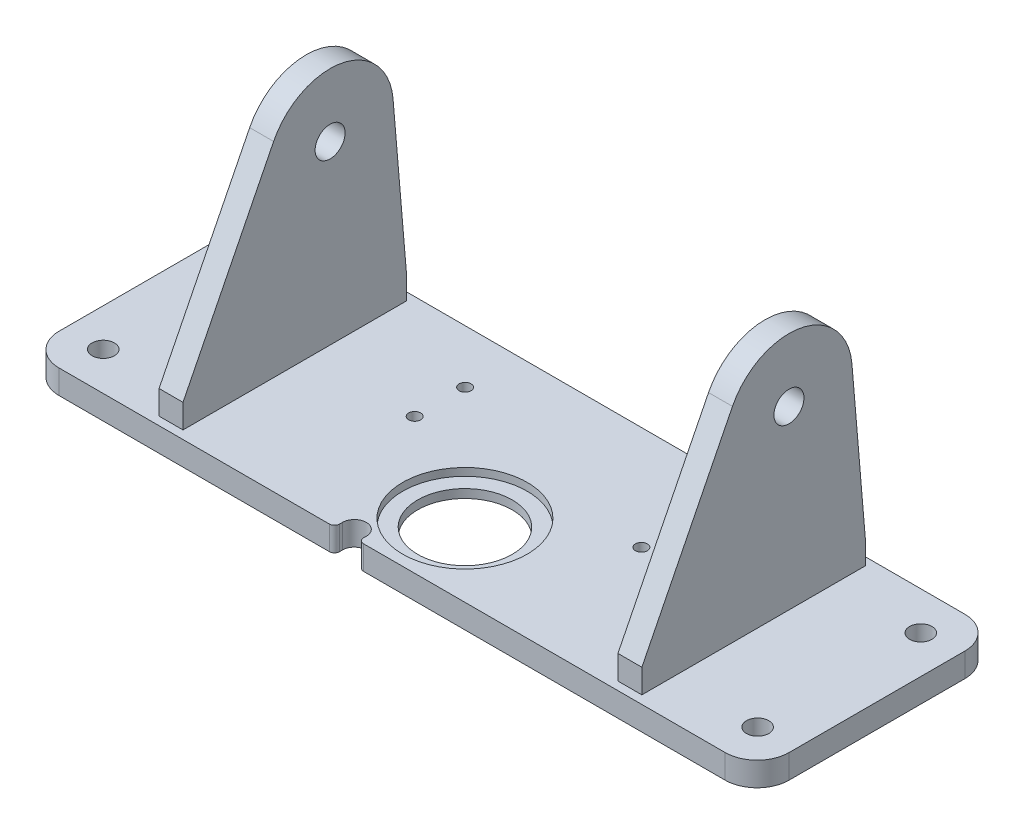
ISO-10303-21;
HEADER;
FILE_DESCRIPTION(('STEP AP214'),'2;1');
FILE_NAME('part.step','',(''),(''),'','','');
FILE_SCHEMA(('AUTOMOTIVE_DESIGN { 1 0 10303 214 1 1 1 1 }'));
ENDSEC;
DATA;
#1=APPLICATION_CONTEXT('core data for automotive mechanical design processes');
#2=APPLICATION_PROTOCOL_DEFINITION('international standard','automotive_design',2000,#1);
#3=PRODUCT_CONTEXT('',#1,'mechanical');
#4=PRODUCT('Part','Part','',(#3));
#5=PRODUCT_RELATED_PRODUCT_CATEGORY('part','',(#4));
#6=PRODUCT_DEFINITION_FORMATION('','',#4);
#7=PRODUCT_DEFINITION_CONTEXT('part definition',#1,'design');
#8=PRODUCT_DEFINITION('design','',#6,#7);
#9=PRODUCT_DEFINITION_SHAPE('','',#8);
#10=(LENGTH_UNIT() NAMED_UNIT(*) SI_UNIT(.MILLI.,.METRE.));
#11=(NAMED_UNIT(*) PLANE_ANGLE_UNIT() SI_UNIT($,.RADIAN.));
#12=(NAMED_UNIT(*) SI_UNIT($,.STERADIAN.) SOLID_ANGLE_UNIT());
#13=UNCERTAINTY_MEASURE_WITH_UNIT(LENGTH_MEASURE(1.E-05),#10,'distance_accuracy_value','');
#14=(GEOMETRIC_REPRESENTATION_CONTEXT(3) GLOBAL_UNCERTAINTY_ASSIGNED_CONTEXT((#13)) GLOBAL_UNIT_ASSIGNED_CONTEXT((#10,
#11,#12)) REPRESENTATION_CONTEXT('',''));
#15=CARTESIAN_POINT('',(0.,0.,0.));
#16=DIRECTION('',(0.,0.,1.));
#17=DIRECTION('',(1.,0.,0.));
#18=AXIS2_PLACEMENT_3D('',#15,#16,#17);
#19=CARTESIAN_POINT('',(86.51875,305.376161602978,-47.6758));
#20=DIRECTION('',(1.,0.,0.));
#21=DIRECTION('',(0.,0.,-1.));
#22=AXIS2_PLACEMENT_3D('',#19,#20,#21);
#23=PLANE('',#22);
#24=DIRECTION('',(0.,-0.996416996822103,-0.0845764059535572));
#25=VECTOR('',#24,1.);
#26=CARTESIAN_POINT('',(86.51875,303.062594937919,-20.4190595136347));
#27=LINE('',#26,#25);
#28=CARTESIAN_POINT('',(86.51875,81.7557583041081,-39.2037018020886));
#29=VERTEX_POINT('',#28);
#30=CARTESIAN_POINT('',(86.51875,19.05,-44.5262));
#31=VERTEX_POINT('',#30);
#32=EDGE_CURVE('E144',#29,#31,#27,.T.);
#33=ORIENTED_EDGE('',*,*,#32,.T.);
#34=DIRECTION('',(0.,-1.,0.));
#35=VECTOR('',#34,1.);
#36=CARTESIAN_POINT('',(86.51875,305.376161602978,-44.5262));
#37=LINE('',#36,#35);
#38=CARTESIAN_POINT('',(86.51875,9.525,-44.5262));
#39=VERTEX_POINT('',#38);
#40=EDGE_CURVE('E135',#31,#39,#37,.T.);
#41=ORIENTED_EDGE('',*,*,#40,.T.);
#42=DIRECTION('',(0.,0.,1.));
#43=VECTOR('',#42,1.);
#44=CARTESIAN_POINT('',(86.51875,9.525,-47.6758));
#45=LINE('',#44,#43);
#46=CARTESIAN_POINT('',(86.51875,9.525,44.3738));
#47=VERTEX_POINT('',#46);
#48=EDGE_CURVE('E147',#39,#47,#45,.T.);
#49=ORIENTED_EDGE('',*,*,#48,.T.);
#50=DIRECTION('',(0.,1.,0.));
#51=VECTOR('',#50,1.);
#52=CARTESIAN_POINT('',(86.51875,305.376161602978,44.3738));
#53=LINE('',#52,#51);
#54=CARTESIAN_POINT('',(86.51875,19.05,44.3738));
#55=VERTEX_POINT('',#54);
#56=EDGE_CURVE('E138',#47,#55,#53,.T.);
#57=ORIENTED_EDGE('',*,*,#56,.T.);
#58=DIRECTION('',(0.,0.893839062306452,-0.448387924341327));
#59=VECTOR('',#58,1.);
#60=CARTESIAN_POINT('',(86.51875,284.702041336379,-88.8886321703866));
#61=LINE('',#60,#59);
#62=CARTESIAN_POINT('',(86.51875,90.904162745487,8.32867706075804));
#63=VERTEX_POINT('',#62);
#64=EDGE_CURVE('E68',#55,#63,#61,.T.);
#65=ORIENTED_EDGE('',*,*,#64,.T.);
#66=CARTESIAN_POINT('',(86.51875,79.629,-14.1478));
#67=DIRECTION('',(1.,0.,0.));
#68=DIRECTION('',(0.,0.,-1.));
#69=AXIS2_PLACEMENT_3D('',#66,#67,#68);
#70=CIRCLE('',#69,25.146);
#71=EDGE_CURVE('E127',#63,#29,#70,.F.);
#72=ORIENTED_EDGE('',*,*,#71,.T.);
#73=EDGE_LOOP('',(#33,#41,#49,#57,#65,#72));
#74=FACE_BOUND('',#73,.T.);
#75=CARTESIAN_POINT('',(86.51875,79.629,-14.1478));
#76=DIRECTION('',(1.,0.,0.));
#77=DIRECTION('',(0.,0.,-1.));
#78=AXIS2_PLACEMENT_3D('',#75,#76,#77);
#79=CIRCLE('',#78,5.969);
#80=CARTESIAN_POINT('',(86.51875,79.629,-20.1168));
#81=VERTEX_POINT('',#80);
#82=EDGE_CURVE('E140',#81,#81,#79,.T.);
#83=ORIENTED_EDGE('',*,*,#82,.T.);
#84=EDGE_LOOP('',(#83));
#85=FACE_BOUND('',#84,.T.);
#86=ADVANCED_FACE('F46',(#74,#85),#23,.F.);
#87=CARTESIAN_POINT('',(96.04375,305.376161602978,-47.6758));
#88=DIRECTION('',(-1.,0.,0.));
#89=DIRECTION('',(0.,0.,1.));
#90=AXIS2_PLACEMENT_3D('',#87,#88,#89);
#91=PLANE('',#90);
#92=CARTESIAN_POINT('',(96.04375,79.629,-14.1478));
#93=DIRECTION('',(1.,0.,0.));
#94=DIRECTION('',(0.,0.,-1.));
#95=AXIS2_PLACEMENT_3D('',#92,#93,#94);
#96=CIRCLE('',#95,5.969);
#97=CARTESIAN_POINT('',(96.04375,79.629,-20.1168));
#98=VERTEX_POINT('',#97);
#99=EDGE_CURVE('E113',#98,#98,#96,.T.);
#100=ORIENTED_EDGE('',*,*,#99,.F.);
#101=EDGE_LOOP('',(#100));
#102=FACE_BOUND('',#101,.T.);
#103=DIRECTION('',(0.,0.893839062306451,-0.448387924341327));
#104=VECTOR('',#103,1.);
#105=CARTESIAN_POINT('',(96.04375,19.05,44.3738));
#106=LINE('',#105,#104);
#107=CARTESIAN_POINT('',(96.04375,19.05,44.3738));
#108=VERTEX_POINT('',#107);
#109=CARTESIAN_POINT('',(96.04375,90.904162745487,8.32867706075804));
#110=VERTEX_POINT('',#109);
#111=EDGE_CURVE('E101',#108,#110,#106,.T.);
#112=ORIENTED_EDGE('',*,*,#111,.F.);
#113=DIRECTION('',(0.,1.,0.));
#114=VECTOR('',#113,1.);
#115=CARTESIAN_POINT('',(96.04375,19.05,44.3738));
#116=LINE('',#115,#114);
#117=CARTESIAN_POINT('',(96.04375,9.525,44.3738));
#118=VERTEX_POINT('',#117);
#119=EDGE_CURVE('E108',#118,#108,#116,.T.);
#120=ORIENTED_EDGE('',*,*,#119,.F.);
#121=DIRECTION('',(0.,0.,-1.));
#122=VECTOR('',#121,1.);
#123=CARTESIAN_POINT('',(96.04375,9.525,-47.6758));
#124=LINE('',#123,#122);
#125=CARTESIAN_POINT('',(96.04375,9.525,-44.5262));
#126=VERTEX_POINT('',#125);
#127=EDGE_CURVE('E148',#118,#126,#124,.T.);
#128=ORIENTED_EDGE('',*,*,#127,.T.);
#129=DIRECTION('',(0.,-1.,0.));
#130=VECTOR('',#129,1.);
#131=CARTESIAN_POINT('',(96.04375,9.525,-44.5262));
#132=LINE('',#131,#130);
#133=CARTESIAN_POINT('',(96.04375,19.05,-44.5262));
#134=VERTEX_POINT('',#133);
#135=EDGE_CURVE('E60',#134,#126,#132,.T.);
#136=ORIENTED_EDGE('',*,*,#135,.F.);
#137=DIRECTION('',(0.,-0.996416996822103,-0.0845764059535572));
#138=VECTOR('',#137,1.);
#139=CARTESIAN_POINT('',(96.04375,19.05,-44.5262));
#140=LINE('',#139,#138);
#141=CARTESIAN_POINT('',(96.04375,81.7557583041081,-39.2037018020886));
#142=VERTEX_POINT('',#141);
#143=EDGE_CURVE('E119',#142,#134,#140,.T.);
#144=ORIENTED_EDGE('',*,*,#143,.F.);
#145=CARTESIAN_POINT('',(96.04375,79.629,-14.1478));
#146=DIRECTION('',(-1.,0.,0.));
#147=DIRECTION('',(0.,0.,-1.));
#148=AXIS2_PLACEMENT_3D('',#145,#146,#147);
#149=CIRCLE('',#148,25.146);
#150=EDGE_CURVE('E117',#110,#142,#149,.T.);
#151=ORIENTED_EDGE('',*,*,#150,.F.);
#152=EDGE_LOOP('',(#112,#120,#128,#136,#144,#151));
#153=FACE_BOUND('',#152,.T.);
#154=ADVANCED_FACE('F115',(#102,#153),#91,.F.);
#155=CARTESIAN_POINT('',(0.,9.525,0.));
#156=DIRECTION('',(0.,1.,0.));
#157=DIRECTION('',(0.,0.,1.));
#158=AXIS2_PLACEMENT_3D('',#155,#156,#157);
#159=PLANE('',#158);
#160=ORIENTED_EDGE('',*,*,#127,.F.);
#161=DIRECTION('',(-1.,0.,0.));
#162=VECTOR('',#161,1.);
#163=CARTESIAN_POINT('',(0.,9.525,44.3738));
#164=LINE('',#163,#162);
#165=EDGE_CURVE('E12',#118,#47,#164,.T.);
#166=ORIENTED_EDGE('',*,*,#165,.T.);
#167=ORIENTED_EDGE('',*,*,#48,.F.);
#168=DIRECTION('',(1.,0.,0.));
#169=VECTOR('',#168,1.);
#170=CARTESIAN_POINT('',(0.,9.525,-44.5262));
#171=LINE('',#170,#169);
#172=EDGE_CURVE('E53',#39,#126,#171,.T.);
#173=ORIENTED_EDGE('',*,*,#172,.T.);
#174=EDGE_LOOP('',(#160,#166,#167,#173));
#175=FACE_BOUND('',#174,.T.);
#176=ADVANCED_FACE('F153',(#175),#159,.F.);
#177=CARTESIAN_POINT('',(-145.1991,19.05,-44.5262));
#178=DIRECTION('',(0.,-0.0845764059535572,0.996416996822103));
#179=DIRECTION('',(0.,-0.996416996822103,-0.0845764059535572));
#180=AXIS2_PLACEMENT_3D('',#177,#178,#179);
#181=PLANE('',#180);
#182=DIRECTION('',(1.,0.,0.));
#183=VECTOR('',#182,1.);
#184=CARTESIAN_POINT('',(-145.1991,81.7557583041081,-39.2037018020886));
#185=LINE('',#184,#183);
#186=EDGE_CURVE('E128',#29,#142,#185,.T.);
#187=ORIENTED_EDGE('',*,*,#186,.T.);
#188=ORIENTED_EDGE('',*,*,#143,.T.);
#189=DIRECTION('',(1.,0.,0.));
#190=VECTOR('',#189,1.);
#191=CARTESIAN_POINT('',(-145.1991,19.05,-44.5262));
#192=LINE('',#191,#190);
#193=EDGE_CURVE('E125',#31,#134,#192,.T.);
#194=ORIENTED_EDGE('',*,*,#193,.F.);
#195=ORIENTED_EDGE('',*,*,#32,.F.);
#196=EDGE_LOOP('',(#187,#188,#194,#195));
#197=FACE_BOUND('',#196,.T.);
#198=ADVANCED_FACE('F156',(#197),#181,.F.);
#199=CARTESIAN_POINT('',(-145.1991,19.05,44.3738));
#200=DIRECTION('',(0.,-0.448387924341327,-0.893839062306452));
#201=DIRECTION('',(0.,0.893839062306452,-0.448387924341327));
#202=AXIS2_PLACEMENT_3D('',#199,#200,#201);
#203=PLANE('',#202);
#204=DIRECTION('',(1.,0.,0.));
#205=VECTOR('',#204,1.);
#206=CARTESIAN_POINT('',(-145.1991,19.05,44.3738));
#207=LINE('',#206,#205);
#208=EDGE_CURVE('E97',#55,#108,#207,.T.);
#209=ORIENTED_EDGE('',*,*,#208,.T.);
#210=ORIENTED_EDGE('',*,*,#111,.T.);
#211=DIRECTION('',(1.,0.,0.));
#212=VECTOR('',#211,1.);
#213=CARTESIAN_POINT('',(-145.1991,90.904162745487,8.328677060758));
#214=LINE('',#213,#212);
#215=EDGE_CURVE('E105',#63,#110,#214,.T.);
#216=ORIENTED_EDGE('',*,*,#215,.F.);
#217=ORIENTED_EDGE('',*,*,#64,.F.);
#218=EDGE_LOOP('',(#209,#210,#216,#217));
#219=FACE_BOUND('',#218,.T.);
#220=ADVANCED_FACE('F99',(#219),#203,.F.);
#221=CARTESIAN_POINT('',(-145.1991,19.05,44.3738));
#222=DIRECTION('',(0.,0.,-1.));
#223=DIRECTION('',(-1.,0.,0.));
#224=AXIS2_PLACEMENT_3D('',#221,#222,#223);
#225=PLANE('',#224);
#226=ORIENTED_EDGE('',*,*,#165,.F.);
#227=ORIENTED_EDGE('',*,*,#119,.T.);
#228=ORIENTED_EDGE('',*,*,#208,.F.);
#229=ORIENTED_EDGE('',*,*,#56,.F.);
#230=EDGE_LOOP('',(#226,#227,#228,#229));
#231=FACE_BOUND('',#230,.T.);
#232=ADVANCED_FACE('F109',(#231),#225,.F.);
#233=CARTESIAN_POINT('',(-145.1991,9.525,-44.5262));
#234=DIRECTION('',(0.,0.,1.));
#235=DIRECTION('',(1.,0.,0.));
#236=AXIS2_PLACEMENT_3D('',#233,#234,#235);
#237=PLANE('',#236);
#238=ORIENTED_EDGE('',*,*,#193,.T.);
#239=ORIENTED_EDGE('',*,*,#135,.T.);
#240=ORIENTED_EDGE('',*,*,#172,.F.);
#241=ORIENTED_EDGE('',*,*,#40,.F.);
#242=EDGE_LOOP('',(#238,#239,#240,#241));
#243=FACE_BOUND('',#242,.T.);
#244=ADVANCED_FACE('F163',(#243),#237,.F.);
#245=CARTESIAN_POINT('',(-145.1991,79.629,-14.1478));
#246=DIRECTION('',(1.,0.,0.));
#247=DIRECTION('',(0.,0.,-1.));
#248=AXIS2_PLACEMENT_3D('',#245,#246,#247);
#249=CYLINDRICAL_SURFACE('',#248,25.146);
#250=ORIENTED_EDGE('',*,*,#215,.T.);
#251=ORIENTED_EDGE('',*,*,#150,.T.);
#252=ORIENTED_EDGE('',*,*,#186,.F.);
#253=ORIENTED_EDGE('',*,*,#71,.F.);
#254=EDGE_LOOP('',(#250,#251,#252,#253));
#255=FACE_BOUND('',#254,.T.);
#256=ADVANCED_FACE('F160',(#255),#249,.T.);
#257=CARTESIAN_POINT('',(-145.1991,79.629,-14.1478));
#258=DIRECTION('',(1.,0.,0.));
#259=DIRECTION('',(0.,0.,-1.));
#260=AXIS2_PLACEMENT_3D('',#257,#258,#259);
#261=CYLINDRICAL_SURFACE('',#260,5.969);
#262=ORIENTED_EDGE('',*,*,#99,.T.);
#263=EDGE_LOOP('',(#262));
#264=FACE_BOUND('',#263,.T.);
#265=ORIENTED_EDGE('',*,*,#82,.F.);
#266=EDGE_LOOP('',(#265));
#267=FACE_BOUND('',#266,.T.);
#268=ADVANCED_FACE('F170',(#264,#267),#261,.F.);
#269=CLOSED_SHELL('',(#86,#154,#176,#198,#220,#232,#244,#256,#268));
#270=MANIFOLD_SOLID_BREP('B2',#269);
#271=CARTESIAN_POINT('',(-96.04375,305.376161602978,-47.6758));
#272=DIRECTION('',(1.,0.,0.));
#273=DIRECTION('',(0.,0.,-1.));
#274=AXIS2_PLACEMENT_3D('',#271,#272,#273);
#275=PLANE('',#274);
#276=DIRECTION('',(0.,-0.996416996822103,-0.0845764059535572));
#277=VECTOR('',#276,1.);
#278=CARTESIAN_POINT('',(-96.04375,303.062594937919,-20.4190595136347));
#279=LINE('',#278,#277);
#280=CARTESIAN_POINT('',(-96.04375,81.7557583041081,-39.2037018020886));
#281=VERTEX_POINT('',#280);
#282=CARTESIAN_POINT('',(-96.04375,19.05,-44.5262));
#283=VERTEX_POINT('',#282);
#284=EDGE_CURVE('E330',#281,#283,#279,.T.);
#285=ORIENTED_EDGE('',*,*,#284,.T.);
#286=DIRECTION('',(0.,-1.,0.));
#287=VECTOR('',#286,1.);
#288=CARTESIAN_POINT('',(-96.04375,305.376161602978,-44.5262));
#289=LINE('',#288,#287);
#290=CARTESIAN_POINT('',(-96.04375,9.525,-44.5262));
#291=VERTEX_POINT('',#290);
#292=EDGE_CURVE('E359',#283,#291,#289,.T.);
#293=ORIENTED_EDGE('',*,*,#292,.T.);
#294=DIRECTION('',(0.,0.,1.));
#295=VECTOR('',#294,1.);
#296=CARTESIAN_POINT('',(-96.04375,9.525,-47.6758));
#297=LINE('',#296,#295);
#298=CARTESIAN_POINT('',(-96.04375,9.525,44.3738));
#299=VERTEX_POINT('',#298);
#300=EDGE_CURVE('E333',#291,#299,#297,.T.);
#301=ORIENTED_EDGE('',*,*,#300,.T.);
#302=DIRECTION('',(0.,1.,0.));
#303=VECTOR('',#302,1.);
#304=CARTESIAN_POINT('',(-96.04375,305.376161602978,44.3738));
#305=LINE('',#304,#303);
#306=CARTESIAN_POINT('',(-96.04375,19.05,44.3738));
#307=VERTEX_POINT('',#306);
#308=EDGE_CURVE('E329',#299,#307,#305,.T.);
#309=ORIENTED_EDGE('',*,*,#308,.T.);
#310=DIRECTION('',(0.,0.893839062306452,-0.448387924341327));
#311=VECTOR('',#310,1.);
#312=CARTESIAN_POINT('',(-96.04375,284.702041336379,-88.8886321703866));
#313=LINE('',#312,#311);
#314=CARTESIAN_POINT('',(-96.04375,90.904162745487,8.32867706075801));
#315=VERTEX_POINT('',#314);
#316=EDGE_CURVE('E322',#307,#315,#313,.T.);
#317=ORIENTED_EDGE('',*,*,#316,.T.);
#318=CARTESIAN_POINT('',(-96.04375,79.629,-14.1478));
#319=DIRECTION('',(1.,0.,0.));
#320=DIRECTION('',(0.,0.,-1.));
#321=AXIS2_PLACEMENT_3D('',#318,#319,#320);
#322=CIRCLE('',#321,25.146);
#323=EDGE_CURVE('E307',#315,#281,#322,.F.);
#324=ORIENTED_EDGE('',*,*,#323,.T.);
#325=EDGE_LOOP('',(#285,#293,#301,#309,#317,#324));
#326=FACE_BOUND('',#325,.T.);
#327=CARTESIAN_POINT('',(-96.04375,79.629,-14.1478));
#328=DIRECTION('',(1.,0.,0.));
#329=DIRECTION('',(0.,0.,-1.));
#330=AXIS2_PLACEMENT_3D('',#327,#328,#329);
#331=CIRCLE('',#330,5.969);
#332=CARTESIAN_POINT('',(-96.04375,79.629,-20.1168));
#333=VERTEX_POINT('',#332);
#334=EDGE_CURVE('E331',#333,#333,#331,.T.);
#335=ORIENTED_EDGE('',*,*,#334,.T.);
#336=EDGE_LOOP('',(#335));
#337=FACE_BOUND('',#336,.T.);
#338=ADVANCED_FACE('F253',(#326,#337),#275,.F.);
#339=CARTESIAN_POINT('',(-86.51875,305.376161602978,-47.6758));
#340=DIRECTION('',(-1.,0.,0.));
#341=DIRECTION('',(0.,0.,1.));
#342=AXIS2_PLACEMENT_3D('',#339,#340,#341);
#343=PLANE('',#342);
#344=CARTESIAN_POINT('',(-86.51875,79.629,-14.1478));
#345=DIRECTION('',(-1.,0.,0.));
#346=DIRECTION('',(0.,0.,1.));
#347=AXIS2_PLACEMENT_3D('',#344,#345,#346);
#348=CIRCLE('',#347,5.969);
#349=CARTESIAN_POINT('',(-86.51875,79.629,-8.17880000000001));
#350=VERTEX_POINT('',#349);
#351=EDGE_CURVE('E336',#350,#350,#348,.T.);
#352=ORIENTED_EDGE('',*,*,#351,.T.);
#353=EDGE_LOOP('',(#352));
#354=FACE_BOUND('',#353,.T.);
#355=DIRECTION('',(0.,-0.893839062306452,0.448387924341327));
#356=VECTOR('',#355,1.);
#357=CARTESIAN_POINT('',(-86.51875,284.702041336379,-88.8886321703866));
#358=LINE('',#357,#356);
#359=CARTESIAN_POINT('',(-86.51875,90.904162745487,8.32867706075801));
#360=VERTEX_POINT('',#359);
#361=CARTESIAN_POINT('',(-86.51875,19.05,44.3738));
#362=VERTEX_POINT('',#361);
#363=EDGE_CURVE('E260',#360,#362,#358,.T.);
#364=ORIENTED_EDGE('',*,*,#363,.T.);
#365=DIRECTION('',(0.,-1.,0.));
#366=VECTOR('',#365,1.);
#367=CARTESIAN_POINT('',(-86.51875,305.376161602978,44.3738));
#368=LINE('',#367,#366);
#369=CARTESIAN_POINT('',(-86.51875,9.525,44.3738));
#370=VERTEX_POINT('',#369);
#371=EDGE_CURVE('E275',#362,#370,#368,.T.);
#372=ORIENTED_EDGE('',*,*,#371,.T.);
#373=DIRECTION('',(0.,0.,-1.));
#374=VECTOR('',#373,1.);
#375=CARTESIAN_POINT('',(-86.51875,9.525,-47.6758));
#376=LINE('',#375,#374);
#377=CARTESIAN_POINT('',(-86.51875,9.525,-44.5262));
#378=VERTEX_POINT('',#377);
#379=EDGE_CURVE('E340',#370,#378,#376,.T.);
#380=ORIENTED_EDGE('',*,*,#379,.T.);
#381=DIRECTION('',(0.,1.,0.));
#382=VECTOR('',#381,1.);
#383=CARTESIAN_POINT('',(-86.51875,305.376161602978,-44.5262));
#384=LINE('',#383,#382);
#385=CARTESIAN_POINT('',(-86.51875,19.05,-44.5262));
#386=VERTEX_POINT('',#385);
#387=EDGE_CURVE('E267',#378,#386,#384,.T.);
#388=ORIENTED_EDGE('',*,*,#387,.T.);
#389=DIRECTION('',(0.,0.996416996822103,0.0845764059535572));
#390=VECTOR('',#389,1.);
#391=CARTESIAN_POINT('',(-86.51875,303.062594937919,-20.4190595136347));
#392=LINE('',#391,#390);
#393=CARTESIAN_POINT('',(-86.51875,81.7557583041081,-39.2037018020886));
#394=VERTEX_POINT('',#393);
#395=EDGE_CURVE('E44',#386,#394,#392,.T.);
#396=ORIENTED_EDGE('',*,*,#395,.T.);
#397=CARTESIAN_POINT('',(-86.51875,79.629,-14.1478));
#398=DIRECTION('',(-1.,0.,0.));
#399=DIRECTION('',(0.,0.,1.));
#400=AXIS2_PLACEMENT_3D('',#397,#398,#399);
#401=CIRCLE('',#400,25.146);
#402=EDGE_CURVE('E318',#394,#360,#401,.F.);
#403=ORIENTED_EDGE('',*,*,#402,.T.);
#404=EDGE_LOOP('',(#364,#372,#380,#388,#396,#403));
#405=FACE_BOUND('',#404,.T.);
#406=ADVANCED_FACE('F351',(#354,#405),#343,.F.);
#407=CARTESIAN_POINT('',(0.,9.525,0.));
#408=DIRECTION('',(0.,1.,0.));
#409=DIRECTION('',(0.,0.,1.));
#410=AXIS2_PLACEMENT_3D('',#407,#408,#409);
#411=PLANE('',#410);
#412=ORIENTED_EDGE('',*,*,#379,.F.);
#413=DIRECTION('',(-1.,0.,0.));
#414=VECTOR('',#413,1.);
#415=CARTESIAN_POINT('',(0.,9.525,44.3738));
#416=LINE('',#415,#414);
#417=EDGE_CURVE('E346',#370,#299,#416,.T.);
#418=ORIENTED_EDGE('',*,*,#417,.T.);
#419=ORIENTED_EDGE('',*,*,#300,.F.);
#420=DIRECTION('',(1.,0.,0.));
#421=VECTOR('',#420,1.);
#422=CARTESIAN_POINT('',(0.,9.525,-44.5262));
#423=LINE('',#422,#421);
#424=EDGE_CURVE('E343',#291,#378,#423,.T.);
#425=ORIENTED_EDGE('',*,*,#424,.T.);
#426=EDGE_LOOP('',(#412,#418,#419,#425));
#427=FACE_BOUND('',#426,.T.);
#428=ADVANCED_FACE('F365',(#427),#411,.F.);
#429=CARTESIAN_POINT('',(-145.1991,19.05,-44.5262));
#430=DIRECTION('',(0.,-0.0845764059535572,0.996416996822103));
#431=DIRECTION('',(0.,-0.996416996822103,-0.0845764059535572));
#432=AXIS2_PLACEMENT_3D('',#429,#430,#431);
#433=PLANE('',#432);
#434=DIRECTION('',(1.,0.,0.));
#435=VECTOR('',#434,1.);
#436=CARTESIAN_POINT('',(-145.1991,81.7557583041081,-39.2037018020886));
#437=LINE('',#436,#435);
#438=EDGE_CURVE('E313',#281,#394,#437,.T.);
#439=ORIENTED_EDGE('',*,*,#438,.T.);
#440=ORIENTED_EDGE('',*,*,#395,.F.);
#441=DIRECTION('',(1.,0.,0.));
#442=VECTOR('',#441,1.);
#443=CARTESIAN_POINT('',(-145.1991,19.05,-44.5262));
#444=LINE('',#443,#442);
#445=EDGE_CURVE('E353',#283,#386,#444,.T.);
#446=ORIENTED_EDGE('',*,*,#445,.F.);
#447=ORIENTED_EDGE('',*,*,#284,.F.);
#448=EDGE_LOOP('',(#439,#440,#446,#447));
#449=FACE_BOUND('',#448,.T.);
#450=ADVANCED_FACE('F375',(#449),#433,.F.);
#451=CARTESIAN_POINT('',(-145.1991,19.05,44.3738));
#452=DIRECTION('',(0.,-0.448387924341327,-0.893839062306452));
#453=DIRECTION('',(0.,0.893839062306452,-0.448387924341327));
#454=AXIS2_PLACEMENT_3D('',#451,#452,#453);
#455=PLANE('',#454);
#456=DIRECTION('',(1.,0.,0.));
#457=VECTOR('',#456,1.);
#458=CARTESIAN_POINT('',(-145.1991,19.05,44.3738));
#459=LINE('',#458,#457);
#460=EDGE_CURVE('E324',#307,#362,#459,.T.);
#461=ORIENTED_EDGE('',*,*,#460,.T.);
#462=ORIENTED_EDGE('',*,*,#363,.F.);
#463=DIRECTION('',(1.,0.,0.));
#464=VECTOR('',#463,1.);
#465=CARTESIAN_POINT('',(-145.1991,90.904162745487,8.328677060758));
#466=LINE('',#465,#464);
#467=EDGE_CURVE('E310',#315,#360,#466,.T.);
#468=ORIENTED_EDGE('',*,*,#467,.F.);
#469=ORIENTED_EDGE('',*,*,#316,.F.);
#470=EDGE_LOOP('',(#461,#462,#468,#469));
#471=FACE_BOUND('',#470,.T.);
#472=ADVANCED_FACE('F321',(#471),#455,.F.);
#473=CARTESIAN_POINT('',(-145.1991,19.05,44.3738));
#474=DIRECTION('',(0.,0.,-1.));
#475=DIRECTION('',(-1.,0.,0.));
#476=AXIS2_PLACEMENT_3D('',#473,#474,#475);
#477=PLANE('',#476);
#478=ORIENTED_EDGE('',*,*,#417,.F.);
#479=ORIENTED_EDGE('',*,*,#371,.F.);
#480=ORIENTED_EDGE('',*,*,#460,.F.);
#481=ORIENTED_EDGE('',*,*,#308,.F.);
#482=EDGE_LOOP('',(#478,#479,#480,#481));
#483=FACE_BOUND('',#482,.T.);
#484=ADVANCED_FACE('F366',(#483),#477,.F.);
#485=CARTESIAN_POINT('',(-145.1991,9.525,-44.5262));
#486=DIRECTION('',(0.,0.,1.));
#487=DIRECTION('',(1.,0.,0.));
#488=AXIS2_PLACEMENT_3D('',#485,#486,#487);
#489=PLANE('',#488);
#490=ORIENTED_EDGE('',*,*,#445,.T.);
#491=ORIENTED_EDGE('',*,*,#387,.F.);
#492=ORIENTED_EDGE('',*,*,#424,.F.);
#493=ORIENTED_EDGE('',*,*,#292,.F.);
#494=EDGE_LOOP('',(#490,#491,#492,#493));
#495=FACE_BOUND('',#494,.T.);
#496=ADVANCED_FACE('F368',(#495),#489,.F.);
#497=CARTESIAN_POINT('',(-145.1991,79.629,-14.1478));
#498=DIRECTION('',(1.,0.,0.));
#499=DIRECTION('',(0.,0.,-1.));
#500=AXIS2_PLACEMENT_3D('',#497,#498,#499);
#501=CYLINDRICAL_SURFACE('',#500,25.146);
#502=ORIENTED_EDGE('',*,*,#467,.T.);
#503=ORIENTED_EDGE('',*,*,#402,.F.);
#504=ORIENTED_EDGE('',*,*,#438,.F.);
#505=ORIENTED_EDGE('',*,*,#323,.F.);
#506=EDGE_LOOP('',(#502,#503,#504,#505));
#507=FACE_BOUND('',#506,.T.);
#508=ADVANCED_FACE('F309',(#507),#501,.T.);
#509=CARTESIAN_POINT('',(-145.1991,79.629,-14.1478));
#510=DIRECTION('',(1.,0.,0.));
#511=DIRECTION('',(0.,0.,-1.));
#512=AXIS2_PLACEMENT_3D('',#509,#510,#511);
#513=CYLINDRICAL_SURFACE('',#512,5.969);
#514=ORIENTED_EDGE('',*,*,#351,.F.);
#515=EDGE_LOOP('',(#514));
#516=FACE_BOUND('',#515,.T.);
#517=ORIENTED_EDGE('',*,*,#334,.F.);
#518=EDGE_LOOP('',(#517));
#519=FACE_BOUND('',#518,.T.);
#520=ADVANCED_FACE('F387',(#516,#519),#513,.F.);
#521=CLOSED_SHELL('',(#338,#406,#428,#450,#472,#484,#496,#508,#520));
#522=MANIFOLD_SOLID_BREP('B6',#521);
#523=CARTESIAN_POINT('',(0.,9.525,18.7198));
#524=DIRECTION('',(0.,-1.,0.));
#525=DIRECTION('',(0.,0.,-1.));
#526=AXIS2_PLACEMENT_3D('',#523,#524,#525);
#527=CYLINDRICAL_SURFACE('',#526,18.796);
#528=CARTESIAN_POINT('',(0.,3.048,18.7198));
#529=DIRECTION('',(0.,-1.,0.));
#530=DIRECTION('',(0.,0.,-1.));
#531=AXIS2_PLACEMENT_3D('',#528,#529,#530);
#532=CIRCLE('',#531,18.796);
#533=CARTESIAN_POINT('',(0.,3.048,-0.076199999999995));
#534=VERTEX_POINT('',#533);
#535=EDGE_CURVE('E583',#534,#534,#532,.T.);
#536=CARTESIAN_POINT('',(0.,6.477,18.7198));
#537=DIRECTION('',(0.,1.,0.));
#538=DIRECTION('',(0.,0.,1.));
#539=AXIS2_PLACEMENT_3D('',#536,#537,#538);
#540=CIRCLE('',#539,18.796);
#541=CARTESIAN_POINT('',(0.,6.477,-0.076199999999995));
#542=VERTEX_POINT('',#541);
#543=EDGE_CURVE('E455',#542,#542,#540,.T.);
#544=CARTESIAN_POINT('',(0.,3.048,-0.076199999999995));
#545=CARTESIAN_POINT('',(0.,3.08371875,-0.076199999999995));
#546=CARTESIAN_POINT('',(0.,3.1194375,-0.076199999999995));
#547=CARTESIAN_POINT('',(0.,3.190875,-0.076199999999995));
#548=CARTESIAN_POINT('',(0.,3.22659375,-0.076199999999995));
#549=CARTESIAN_POINT('',(0.,3.29803125,-0.076199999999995));
#550=CARTESIAN_POINT('',(0.,3.33375,-0.076199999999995));
#551=CARTESIAN_POINT('',(0.,3.4051875,-0.076199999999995));
#552=CARTESIAN_POINT('',(0.,3.44090625,-0.076199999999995));
#553=CARTESIAN_POINT('',(0.,3.51234375,-0.076199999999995));
#554=CARTESIAN_POINT('',(0.,3.5480625,-0.076199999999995));
#555=CARTESIAN_POINT('',(0.,3.6195,-0.076199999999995));
#556=CARTESIAN_POINT('',(0.,3.65521875,-0.076199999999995));
#557=CARTESIAN_POINT('',(0.,3.72665625,-0.076199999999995));
#558=CARTESIAN_POINT('',(0.,3.762375,-0.076199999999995));
#559=CARTESIAN_POINT('',(0.,3.8338125,-0.076199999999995));
#560=CARTESIAN_POINT('',(0.,3.86953125,-0.076199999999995));
#561=CARTESIAN_POINT('',(0.,3.94096875,-0.076199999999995));
#562=CARTESIAN_POINT('',(0.,3.9766875,-0.076199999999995));
#563=CARTESIAN_POINT('',(0.,4.048125,-0.076199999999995));
#564=CARTESIAN_POINT('',(0.,4.08384375,-0.076199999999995));
#565=CARTESIAN_POINT('',(0.,4.15528125,-0.076199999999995));
#566=CARTESIAN_POINT('',(0.,4.191,-0.076199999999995));
#567=CARTESIAN_POINT('',(0.,4.2624375,-0.076199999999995));
#568=CARTESIAN_POINT('',(0.,4.29815625,-0.076199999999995));
#569=CARTESIAN_POINT('',(0.,4.36959375,-0.076199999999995));
#570=CARTESIAN_POINT('',(0.,4.4053125,-0.076199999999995));
#571=CARTESIAN_POINT('',(0.,4.47675,-0.076199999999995));
#572=CARTESIAN_POINT('',(0.,4.51246875,-0.076199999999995));
#573=CARTESIAN_POINT('',(0.,4.58390625,-0.076199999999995));
#574=CARTESIAN_POINT('',(0.,4.619625,-0.076199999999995));
#575=CARTESIAN_POINT('',(0.,4.6910625,-0.076199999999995));
#576=CARTESIAN_POINT('',(0.,4.72678125,-0.076199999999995));
#577=CARTESIAN_POINT('',(0.,4.79821875,-0.076199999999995));
#578=CARTESIAN_POINT('',(0.,4.8339375,-0.076199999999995));
#579=CARTESIAN_POINT('',(0.,4.905375,-0.076199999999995));
#580=CARTESIAN_POINT('',(0.,4.94109375,-0.076199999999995));
#581=CARTESIAN_POINT('',(0.,5.01253125,-0.076199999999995));
#582=CARTESIAN_POINT('',(0.,5.04825,-0.076199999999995));
#583=CARTESIAN_POINT('',(0.,5.1196875,-0.076199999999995));
#584=CARTESIAN_POINT('',(0.,5.15540625,-0.076199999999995));
#585=CARTESIAN_POINT('',(0.,5.22684375,-0.076199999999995));
#586=CARTESIAN_POINT('',(0.,5.2625625,-0.076199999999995));
#587=CARTESIAN_POINT('',(0.,5.334,-0.076199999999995));
#588=CARTESIAN_POINT('',(0.,5.36971875,-0.076199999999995));
#589=CARTESIAN_POINT('',(0.,5.44115625,-0.076199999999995));
#590=CARTESIAN_POINT('',(0.,5.476875,-0.076199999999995));
#591=CARTESIAN_POINT('',(0.,5.5483125,-0.076199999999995));
#592=CARTESIAN_POINT('',(0.,5.58403125,-0.076199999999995));
#593=CARTESIAN_POINT('',(0.,5.65546875,-0.076199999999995));
#594=CARTESIAN_POINT('',(0.,5.6911875,-0.076199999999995));
#595=CARTESIAN_POINT('',(0.,5.762625,-0.076199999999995));
#596=CARTESIAN_POINT('',(0.,5.79834375,-0.076199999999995));
#597=CARTESIAN_POINT('',(0.,5.86978125,-0.076199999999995));
#598=CARTESIAN_POINT('',(0.,5.9055,-0.076199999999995));
#599=CARTESIAN_POINT('',(0.,5.9769375,-0.076199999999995));
#600=CARTESIAN_POINT('',(0.,6.01265625,-0.076199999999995));
#601=CARTESIAN_POINT('',(0.,6.08409375,-0.076199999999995));
#602=CARTESIAN_POINT('',(0.,6.1198125,-0.076199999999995));
#603=CARTESIAN_POINT('',(0.,6.19125,-0.076199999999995));
#604=CARTESIAN_POINT('',(0.,6.22696875,-0.076199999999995));
#605=CARTESIAN_POINT('',(0.,6.29840625,-0.076199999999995));
#606=CARTESIAN_POINT('',(0.,6.334125,-0.076199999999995));
#607=CARTESIAN_POINT('',(0.,6.4055625,-0.076199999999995));
#608=CARTESIAN_POINT('',(0.,6.44128125,-0.076199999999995));
#609=CARTESIAN_POINT('',(0.,6.477,-0.076199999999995));
#610=B_SPLINE_CURVE_WITH_KNOTS('',3,(#544,#545,#546,#547,#548,#549,#550,#551,#552,#553,#554,
#555,#556,#557,#558,#559,#560,#561,#562,#563,#564,#565,#566,#567,#568,#569,#570,#571,#572,#573,
#574,#575,#576,#577,#578,#579,#580,#581,#582,#583,#584,#585,#586,#587,#588,#589,#590,#591,#592,
#593,#594,#595,#596,#597,#598,#599,#600,#601,#602,#603,#604,#605,#606,#607,#608,#609),
.UNSPECIFIED.,.F.,.F.,(4,2,2,2,2,2,2,2,2,2,2,2,2,2,2,2,2,2,2,2,2,2,2,2,2,2,2,2,2,2,2,2,4),(0.,
0.10715625,0.2143125,0.32146875,0.428625,0.53578125,0.642937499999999,0.75009375,0.85725,
0.96440625,1.0715625,1.17871875,1.285875,1.39303125,1.5001875,1.60734375,1.7145,1.82165625,
1.9288125,2.03596875,2.143125,2.25028125,2.3574375,2.46459375,2.57175,2.67890625,2.7860625,
2.89321875,3.000375,3.10753125,3.2146875,3.32184375,3.429),.UNSPECIFIED.);
#611=EDGE_CURVE('BSEAM451',#534,#542,#610,.T.);
#612=ORIENTED_EDGE('',*,*,#535,.T.);
#613=ORIENTED_EDGE('',*,*,#543,.T.);
#614=ORIENTED_EDGE('',*,*,#611,.T.);
#615=ORIENTED_EDGE('',*,*,#611,.F.);
#616=EDGE_LOOP('',(#612,#614,#613,#615));
#617=FACE_BOUND('',#616,.T.);
#618=ADVANCED_FACE('F451',(#617),#527,.F.);
#619=CARTESIAN_POINT('',(-145.1991,9.525,47.6758));
#620=DIRECTION('',(0.,0.,-1.));
#621=DIRECTION('',(-1.,0.,0.));
#622=AXIS2_PLACEMENT_3D('',#619,#620,#621);
#623=PLANE('',#622);
#624=DIRECTION('',(1.,0.,0.));
#625=VECTOR('',#624,1.);
#626=CARTESIAN_POINT('',(-145.1991,9.525,47.6758));
#627=LINE('',#626,#625);
#628=CARTESIAN_POINT('',(-11.4046000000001,9.525,47.6758));
#629=VERTEX_POINT('',#628);
#630=CARTESIAN_POINT('',(132.4991,9.525,47.6758));
#631=VERTEX_POINT('',#630);
#632=EDGE_CURVE('E640',#629,#631,#627,.T.);
#633=ORIENTED_EDGE('',*,*,#632,.F.);
#634=DIRECTION('',(0.,1.,0.));
#635=VECTOR('',#634,1.);
#636=CARTESIAN_POINT('',(-11.4046000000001,9.525,47.6758));
#637=LINE('',#636,#635);
#638=CARTESIAN_POINT('',(-11.4046000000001,0.,47.6758));
#639=VERTEX_POINT('',#638);
#640=EDGE_CURVE('E699',#629,#639,#637,.F.);
#641=ORIENTED_EDGE('',*,*,#640,.T.);
#642=DIRECTION('',(1.,0.,0.));
#643=VECTOR('',#642,1.);
#644=CARTESIAN_POINT('',(-145.1991,0.,47.6758));
#645=LINE('',#644,#643);
#646=CARTESIAN_POINT('',(132.4991,0.,47.6758));
#647=VERTEX_POINT('',#646);
#648=EDGE_CURVE('E653',#639,#647,#645,.T.);
#649=ORIENTED_EDGE('',*,*,#648,.T.);
#650=DIRECTION('',(0.,-1.,0.));
#651=VECTOR('',#650,1.);
#652=CARTESIAN_POINT('',(132.4991,9.525,47.6758));
#653=LINE('',#652,#651);
#654=EDGE_CURVE('E689',#647,#631,#653,.F.);
#655=ORIENTED_EDGE('',*,*,#654,.T.);
#656=EDGE_LOOP('',(#633,#641,#649,#655));
#657=FACE_BOUND('',#656,.T.);
#658=ADVANCED_FACE('F730',(#657),#623,.F.);
#659=CARTESIAN_POINT('',(0.,9.525,0.));
#660=DIRECTION('',(0.,1.,0.));
#661=DIRECTION('',(0.,0.,1.));
#662=AXIS2_PLACEMENT_3D('',#659,#660,#661);
#663=PLANE('',#662);
#664=CARTESIAN_POINT('',(0.,9.525,18.7198));
#665=DIRECTION('',(0.,1.,0.));
#666=DIRECTION('',(0.,0.,1.));
#667=AXIS2_PLACEMENT_3D('',#664,#665,#666);
#668=CIRCLE('',#667,24.765);
#669=CARTESIAN_POINT('',(0.,9.525,43.4848));
#670=VERTEX_POINT('',#669);
#671=EDGE_CURVE('E717',#670,#670,#668,.T.);
#672=ORIENTED_EDGE('',*,*,#671,.F.);
#673=EDGE_LOOP('',(#672));
#674=FACE_BOUND('',#673,.T.);
#675=CARTESIAN_POINT('',(130.175,9.525,-32.4612));
#676=DIRECTION('',(0.,1.,0.));
#677=DIRECTION('',(0.,0.,1.));
#678=AXIS2_PLACEMENT_3D('',#675,#676,#677);
#679=CIRCLE('',#678,4.445);
#680=CARTESIAN_POINT('',(130.175,9.525,-28.0162));
#681=VERTEX_POINT('',#680);
#682=EDGE_CURVE('E604',#681,#681,#679,.T.);
#683=ORIENTED_EDGE('',*,*,#682,.F.);
#684=EDGE_LOOP('',(#683));
#685=FACE_BOUND('',#684,.T.);
#686=CARTESIAN_POINT('',(130.175,9.525,32.4612));
#687=DIRECTION('',(0.,1.,0.));
#688=DIRECTION('',(0.,0.,1.));
#689=AXIS2_PLACEMENT_3D('',#686,#687,#688);
#690=CIRCLE('',#689,4.445);
#691=CARTESIAN_POINT('',(130.175,9.525,36.9062));
#692=VERTEX_POINT('',#691);
#693=EDGE_CURVE('E610',#692,#692,#690,.T.);
#694=ORIENTED_EDGE('',*,*,#693,.F.);
#695=EDGE_LOOP('',(#694));
#696=FACE_BOUND('',#695,.T.);
#697=CARTESIAN_POINT('',(-130.175,9.525,32.4612));
#698=DIRECTION('',(0.,1.,0.));
#699=DIRECTION('',(0.,0.,1.));
#700=AXIS2_PLACEMENT_3D('',#697,#698,#699);
#701=CIRCLE('',#700,4.445);
#702=CARTESIAN_POINT('',(-130.175,9.525,36.9062));
#703=VERTEX_POINT('',#702);
#704=EDGE_CURVE('E616',#703,#703,#701,.T.);
#705=ORIENTED_EDGE('',*,*,#704,.F.);
#706=EDGE_LOOP('',(#705));
#707=FACE_BOUND('',#706,.T.);
#708=CARTESIAN_POINT('',(45.10405,9.525,-26.4414));
#709=DIRECTION('',(0.,1.,0.));
#710=DIRECTION('',(0.,0.,1.));
#711=AXIS2_PLACEMENT_3D('',#708,#709,#710);
#712=CIRCLE('',#711,2.38760000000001);
#713=CARTESIAN_POINT('',(45.10405,9.525,-24.0538));
#714=VERTEX_POINT('',#713);
#715=EDGE_CURVE('E589',#714,#714,#712,.T.);
#716=ORIENTED_EDGE('',*,*,#715,.F.);
#717=EDGE_LOOP('',(#716));
#718=FACE_BOUND('',#717,.T.);
#719=DIRECTION('',(0.,0.,-1.));
#720=VECTOR('',#719,1.);
#721=CARTESIAN_POINT('',(-13.4366000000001,9.525,44.5008));
#722=LINE('',#721,#720);
#723=CARTESIAN_POINT('',(-13.4366000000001,9.525,45.6438));
#724=VERTEX_POINT('',#723);
#725=CARTESIAN_POINT('',(-13.4366000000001,9.525,44.5008));
#726=VERTEX_POINT('',#725);
#727=EDGE_CURVE('E573',#724,#726,#722,.T.);
#728=ORIENTED_EDGE('',*,*,#727,.F.);
#729=CARTESIAN_POINT('',(-11.4046000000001,9.525,45.6438));
#730=DIRECTION('',(0.,1.,0.));
#731=DIRECTION('',(0.,0.,1.));
#732=AXIS2_PLACEMENT_3D('',#729,#730,#731);
#733=CIRCLE('',#732,2.032);
#734=EDGE_CURVE('E697',#724,#629,#733,.T.);
#735=ORIENTED_EDGE('',*,*,#734,.T.);
#736=ORIENTED_EDGE('',*,*,#632,.T.);
#737=CARTESIAN_POINT('',(132.4991,9.525,34.9758));
#738=DIRECTION('',(0.,1.,0.));
#739=DIRECTION('',(0.,0.,1.));
#740=AXIS2_PLACEMENT_3D('',#737,#738,#739);
#741=CIRCLE('',#740,12.7);
#742=CARTESIAN_POINT('',(145.1991,9.525,34.9758));
#743=VERTEX_POINT('',#742);
#744=EDGE_CURVE('E673',#631,#743,#741,.T.);
#745=ORIENTED_EDGE('',*,*,#744,.T.);
#746=DIRECTION('',(0.,0.,-1.));
#747=VECTOR('',#746,1.);
#748=CARTESIAN_POINT('',(145.1991,9.525,-47.6758));
#749=LINE('',#748,#747);
#750=CARTESIAN_POINT('',(145.1991,9.525,-34.9758));
#751=VERTEX_POINT('',#750);
#752=EDGE_CURVE('E630',#743,#751,#749,.T.);
#753=ORIENTED_EDGE('',*,*,#752,.T.);
#754=CARTESIAN_POINT('',(132.4991,9.525,-34.9758));
#755=DIRECTION('',(0.,1.,0.));
#756=DIRECTION('',(0.,0.,1.));
#757=AXIS2_PLACEMENT_3D('',#754,#755,#756);
#758=CIRCLE('',#757,12.7);
#759=CARTESIAN_POINT('',(132.4991,9.525,-47.6758));
#760=VERTEX_POINT('',#759);
#761=EDGE_CURVE('E675',#751,#760,#758,.T.);
#762=ORIENTED_EDGE('',*,*,#761,.T.);
#763=DIRECTION('',(-1.,0.,0.));
#764=VECTOR('',#763,1.);
#765=CARTESIAN_POINT('',(-145.1991,9.525,-47.6758));
#766=LINE('',#765,#764);
#767=CARTESIAN_POINT('',(-132.4991,9.525,-47.6758));
#768=VERTEX_POINT('',#767);
#769=EDGE_CURVE('E633',#760,#768,#766,.T.);
#770=ORIENTED_EDGE('',*,*,#769,.T.);
#771=CARTESIAN_POINT('',(-132.4991,9.525,-34.9758));
#772=DIRECTION('',(0.,1.,0.));
#773=DIRECTION('',(0.,0.,1.));
#774=AXIS2_PLACEMENT_3D('',#771,#772,#773);
#775=CIRCLE('',#774,12.7);
#776=CARTESIAN_POINT('',(-145.1991,9.525,-34.9758));
#777=VERTEX_POINT('',#776);
#778=EDGE_CURVE('E679',#768,#777,#775,.T.);
#779=ORIENTED_EDGE('',*,*,#778,.T.);
#780=DIRECTION('',(0.,0.,1.));
#781=VECTOR('',#780,1.);
#782=CARTESIAN_POINT('',(-145.1991,9.525,-47.6758));
#783=LINE('',#782,#781);
#784=CARTESIAN_POINT('',(-145.1991,9.525,34.9758));
#785=VERTEX_POINT('',#784);
#786=EDGE_CURVE('E637',#777,#785,#783,.T.);
#787=ORIENTED_EDGE('',*,*,#786,.T.);
#788=CARTESIAN_POINT('',(-132.4991,9.525,34.9758));
#789=DIRECTION('',(0.,1.,0.));
#790=DIRECTION('',(0.,0.,1.));
#791=AXIS2_PLACEMENT_3D('',#788,#789,#790);
#792=CIRCLE('',#791,12.7);
#793=CARTESIAN_POINT('',(-132.4991,9.525,47.6758));
#794=VERTEX_POINT('',#793);
#795=EDGE_CURVE('E677',#785,#794,#792,.T.);
#796=ORIENTED_EDGE('',*,*,#795,.T.);
#797=CARTESIAN_POINT('',(-24.9936000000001,9.525,47.6758));
#798=VERTEX_POINT('',#797);
#799=EDGE_CURVE('E641',#794,#798,#627,.T.);
#800=ORIENTED_EDGE('',*,*,#799,.T.);
#801=CARTESIAN_POINT('',(-24.9936000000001,9.525,45.6438));
#802=DIRECTION('',(0.,1.,0.));
#803=DIRECTION('',(0.,0.,1.));
#804=AXIS2_PLACEMENT_3D('',#801,#802,#803);
#805=CIRCLE('',#804,2.032);
#806=CARTESIAN_POINT('',(-22.9616000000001,9.525,45.6438));
#807=VERTEX_POINT('',#806);
#808=EDGE_CURVE('E695',#798,#807,#805,.T.);
#809=ORIENTED_EDGE('',*,*,#808,.T.);
#810=DIRECTION('',(0.,0.,1.));
#811=VECTOR('',#810,1.);
#812=CARTESIAN_POINT('',(-22.9616000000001,9.525,44.5008));
#813=LINE('',#812,#811);
#814=CARTESIAN_POINT('',(-22.9616000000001,9.525,44.5008));
#815=VERTEX_POINT('',#814);
#816=EDGE_CURVE('E575',#815,#807,#813,.T.);
#817=ORIENTED_EDGE('',*,*,#816,.F.);
#818=CARTESIAN_POINT('',(-18.1991000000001,9.525,44.5008));
#819=DIRECTION('',(0.,1.,0.));
#820=DIRECTION('',(0.,0.,-1.));
#821=AXIS2_PLACEMENT_3D('',#818,#819,#820);
#822=CIRCLE('',#821,4.7625);
#823=EDGE_CURVE('E561',#726,#815,#822,.T.);
#824=ORIENTED_EDGE('',*,*,#823,.F.);
#825=EDGE_LOOP('',(#728,#735,#736,#745,#753,#762,#770,#779,#787,#796,#800,#809,#817,#824));
#826=FACE_BOUND('',#825,.T.);
#827=CARTESIAN_POINT('',(-45.10405,9.525,-26.4414));
#828=DIRECTION('',(0.,1.,0.));
#829=DIRECTION('',(0.,0.,1.));
#830=AXIS2_PLACEMENT_3D('',#827,#828,#829);
#831=CIRCLE('',#830,2.3876);
#832=CARTESIAN_POINT('',(-45.10405,9.525,-24.0538));
#833=VERTEX_POINT('',#832);
#834=EDGE_CURVE('E578',#833,#833,#831,.T.);
#835=ORIENTED_EDGE('',*,*,#834,.F.);
#836=EDGE_LOOP('',(#835));
#837=FACE_BOUND('',#836,.T.);
#838=CARTESIAN_POINT('',(-45.10405,9.525,-6.37539999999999));
#839=DIRECTION('',(0.,1.,0.));
#840=DIRECTION('',(0.,0.,1.));
#841=AXIS2_PLACEMENT_3D('',#838,#839,#840);
#842=CIRCLE('',#841,2.3876);
#843=CARTESIAN_POINT('',(-45.10405,9.525,-3.9878));
#844=VERTEX_POINT('',#843);
#845=EDGE_CURVE('E596',#844,#844,#842,.T.);
#846=ORIENTED_EDGE('',*,*,#845,.F.);
#847=EDGE_LOOP('',(#846));
#848=FACE_BOUND('',#847,.T.);
#849=CARTESIAN_POINT('',(45.10405,9.525,-6.3754));
#850=DIRECTION('',(0.,1.,0.));
#851=DIRECTION('',(0.,0.,1.));
#852=AXIS2_PLACEMENT_3D('',#849,#850,#851);
#853=CIRCLE('',#852,2.38760000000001);
#854=CARTESIAN_POINT('',(45.10405,9.525,-3.98779999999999));
#855=VERTEX_POINT('',#854);
#856=EDGE_CURVE('E590',#855,#855,#853,.T.);
#857=ORIENTED_EDGE('',*,*,#856,.F.);
#858=EDGE_LOOP('',(#857));
#859=FACE_BOUND('',#858,.T.);
#860=CARTESIAN_POINT('',(-130.175,9.525,-32.4612));
#861=DIRECTION('',(0.,1.,0.));
#862=DIRECTION('',(0.,0.,1.));
#863=AXIS2_PLACEMENT_3D('',#860,#861,#862);
#864=CIRCLE('',#863,4.445);
#865=CARTESIAN_POINT('',(-130.175,9.525,-28.0162));
#866=VERTEX_POINT('',#865);
#867=EDGE_CURVE('E603',#866,#866,#864,.T.);
#868=ORIENTED_EDGE('',*,*,#867,.F.);
#869=EDGE_LOOP('',(#868));
#870=FACE_BOUND('',#869,.T.);
#871=ADVANCED_FACE('F727',(#674,#685,#696,#707,#718,#826,#837,#848,#859,#870),#663,.T.);
#872=CARTESIAN_POINT('',(0.,0.,0.));
#873=DIRECTION('',(0.,1.,0.));
#874=DIRECTION('',(0.,0.,1.));
#875=AXIS2_PLACEMENT_3D('',#872,#873,#874);
#876=PLANE('',#875);
#877=CARTESIAN_POINT('',(0.,0.,18.7198));
#878=DIRECTION('',(0.,-1.,0.));
#879=DIRECTION('',(0.,0.,-1.));
#880=AXIS2_PLACEMENT_3D('',#877,#878,#879);
#881=CIRCLE('',#880,24.765);
#882=CARTESIAN_POINT('',(0.,0.,-6.04519999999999));
#883=VERTEX_POINT('',#882);
#884=EDGE_CURVE('E710',#883,#883,#881,.T.);
#885=ORIENTED_EDGE('',*,*,#884,.F.);
#886=EDGE_LOOP('',(#885));
#887=FACE_BOUND('',#886,.T.);
#888=CARTESIAN_POINT('',(130.175,0.,-32.4612));
#889=DIRECTION('',(0.,1.,0.));
#890=DIRECTION('',(0.,0.,1.));
#891=AXIS2_PLACEMENT_3D('',#888,#889,#890);
#892=CIRCLE('',#891,4.445);
#893=CARTESIAN_POINT('',(130.175,0.,-28.0162));
#894=VERTEX_POINT('',#893);
#895=EDGE_CURVE('E600',#894,#894,#892,.T.);
#896=ORIENTED_EDGE('',*,*,#895,.T.);
#897=EDGE_LOOP('',(#896));
#898=FACE_BOUND('',#897,.T.);
#899=CARTESIAN_POINT('',(130.175,0.,32.4612));
#900=DIRECTION('',(0.,1.,0.));
#901=DIRECTION('',(0.,0.,1.));
#902=AXIS2_PLACEMENT_3D('',#899,#900,#901);
#903=CIRCLE('',#902,4.445);
#904=CARTESIAN_POINT('',(130.175,0.,36.9062));
#905=VERTEX_POINT('',#904);
#906=EDGE_CURVE('E607',#905,#905,#903,.T.);
#907=ORIENTED_EDGE('',*,*,#906,.T.);
#908=EDGE_LOOP('',(#907));
#909=FACE_BOUND('',#908,.T.);
#910=CARTESIAN_POINT('',(-130.175,0.,32.4612));
#911=DIRECTION('',(0.,1.,0.));
#912=DIRECTION('',(0.,0.,1.));
#913=AXIS2_PLACEMENT_3D('',#910,#911,#912);
#914=CIRCLE('',#913,4.445);
#915=CARTESIAN_POINT('',(-130.175,0.,36.9062));
#916=VERTEX_POINT('',#915);
#917=EDGE_CURVE('E613',#916,#916,#914,.T.);
#918=ORIENTED_EDGE('',*,*,#917,.T.);
#919=EDGE_LOOP('',(#918));
#920=FACE_BOUND('',#919,.T.);
#921=CARTESIAN_POINT('',(45.10405,0.,-26.4414));
#922=DIRECTION('',(0.,1.,0.));
#923=DIRECTION('',(0.,0.,1.));
#924=AXIS2_PLACEMENT_3D('',#921,#922,#923);
#925=CIRCLE('',#924,2.38760000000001);
#926=CARTESIAN_POINT('',(45.10405,0.,-24.0538));
#927=VERTEX_POINT('',#926);
#928=EDGE_CURVE('E619',#927,#927,#925,.T.);
#929=ORIENTED_EDGE('',*,*,#928,.T.);
#930=EDGE_LOOP('',(#929));
#931=FACE_BOUND('',#930,.T.);
#932=CARTESIAN_POINT('',(-45.10405,0.,-26.4414));
#933=DIRECTION('',(0.,1.,0.));
#934=DIRECTION('',(0.,0.,1.));
#935=AXIS2_PLACEMENT_3D('',#932,#933,#934);
#936=CIRCLE('',#935,2.3876);
#937=CARTESIAN_POINT('',(-45.10405,0.,-24.0538));
#938=VERTEX_POINT('',#937);
#939=EDGE_CURVE('E599',#938,#938,#936,.T.);
#940=ORIENTED_EDGE('',*,*,#939,.T.);
#941=EDGE_LOOP('',(#940));
#942=FACE_BOUND('',#941,.T.);
#943=CARTESIAN_POINT('',(-45.10405,0.,-6.37539999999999));
#944=DIRECTION('',(0.,1.,0.));
#945=DIRECTION('',(0.,0.,1.));
#946=AXIS2_PLACEMENT_3D('',#943,#944,#945);
#947=CIRCLE('',#946,2.3876);
#948=CARTESIAN_POINT('',(-45.10405,0.,-3.9878));
#949=VERTEX_POINT('',#948);
#950=EDGE_CURVE('E593',#949,#949,#947,.T.);
#951=ORIENTED_EDGE('',*,*,#950,.T.);
#952=EDGE_LOOP('',(#951));
#953=FACE_BOUND('',#952,.T.);
#954=CARTESIAN_POINT('',(45.10405,0.,-6.3754));
#955=DIRECTION('',(0.,1.,0.));
#956=DIRECTION('',(0.,0.,1.));
#957=AXIS2_PLACEMENT_3D('',#954,#955,#956);
#958=CIRCLE('',#957,2.38760000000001);
#959=CARTESIAN_POINT('',(45.10405,0.,-3.98779999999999));
#960=VERTEX_POINT('',#959);
#961=EDGE_CURVE('E586',#960,#960,#958,.T.);
#962=ORIENTED_EDGE('',*,*,#961,.T.);
#963=EDGE_LOOP('',(#962));
#964=FACE_BOUND('',#963,.T.);
#965=CARTESIAN_POINT('',(-130.175,0.,-32.4612));
#966=DIRECTION('',(0.,1.,0.));
#967=DIRECTION('',(0.,0.,1.));
#968=AXIS2_PLACEMENT_3D('',#965,#966,#967);
#969=CIRCLE('',#968,4.445);
#970=CARTESIAN_POINT('',(-130.175,0.,-28.0162));
#971=VERTEX_POINT('',#970);
#972=EDGE_CURVE('E624',#971,#971,#969,.T.);
#973=ORIENTED_EDGE('',*,*,#972,.T.);
#974=EDGE_LOOP('',(#973));
#975=FACE_BOUND('',#974,.T.);
#976=ORIENTED_EDGE('',*,*,#648,.F.);
#977=CARTESIAN_POINT('',(-11.4046000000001,0.,45.6438));
#978=DIRECTION('',(0.,1.,0.));
#979=DIRECTION('',(0.,0.,1.));
#980=AXIS2_PLACEMENT_3D('',#977,#978,#979);
#981=CIRCLE('',#980,2.032);
#982=CARTESIAN_POINT('',(-13.4366000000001,0.,45.6438));
#983=VERTEX_POINT('',#982);
#984=EDGE_CURVE('E702',#639,#983,#981,.F.);
#985=ORIENTED_EDGE('',*,*,#984,.T.);
#986=DIRECTION('',(0.,0.,-1.));
#987=VECTOR('',#986,1.);
#988=CARTESIAN_POINT('',(-13.4366000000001,0.,44.5008));
#989=LINE('',#988,#987);
#990=CARTESIAN_POINT('',(-13.4366000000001,0.,44.5008));
#991=VERTEX_POINT('',#990);
#992=EDGE_CURVE('E564',#983,#991,#989,.T.);
#993=ORIENTED_EDGE('',*,*,#992,.T.);
#994=CARTESIAN_POINT('',(-18.1991000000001,0.,44.5008));
#995=DIRECTION('',(0.,1.,0.));
#996=DIRECTION('',(0.,0.,-1.));
#997=AXIS2_PLACEMENT_3D('',#994,#995,#996);
#998=CIRCLE('',#997,4.7625);
#999=CARTESIAN_POINT('',(-22.9616000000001,0.,44.5008));
#1000=VERTEX_POINT('',#999);
#1001=EDGE_CURVE('E559',#991,#1000,#998,.T.);
#1002=ORIENTED_EDGE('',*,*,#1001,.T.);
#1003=DIRECTION('',(0.,0.,1.));
#1004=VECTOR('',#1003,1.);
#1005=CARTESIAN_POINT('',(-22.9616000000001,0.,44.5008));
#1006=LINE('',#1005,#1004);
#1007=CARTESIAN_POINT('',(-22.9616000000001,0.,45.6438));
#1008=VERTEX_POINT('',#1007);
#1009=EDGE_CURVE('E566',#1000,#1008,#1006,.T.);
#1010=ORIENTED_EDGE('',*,*,#1009,.T.);
#1011=CARTESIAN_POINT('',(-24.9936000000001,0.,45.6438));
#1012=DIRECTION('',(0.,1.,0.));
#1013=DIRECTION('',(0.,0.,1.));
#1014=AXIS2_PLACEMENT_3D('',#1011,#1012,#1013);
#1015=CIRCLE('',#1014,2.032);
#1016=CARTESIAN_POINT('',(-24.9936000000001,0.,47.6758));
#1017=VERTEX_POINT('',#1016);
#1018=EDGE_CURVE('E468',#1008,#1017,#1015,.F.);
#1019=ORIENTED_EDGE('',*,*,#1018,.T.);
#1020=CARTESIAN_POINT('',(-132.4991,0.,47.6758));
#1021=VERTEX_POINT('',#1020);
#1022=EDGE_CURVE('E634',#1021,#1017,#645,.T.);
#1023=ORIENTED_EDGE('',*,*,#1022,.F.);
#1024=CARTESIAN_POINT('',(-132.4991,0.,34.9758));
#1025=DIRECTION('',(0.,1.,0.));
#1026=DIRECTION('',(0.,0.,1.));
#1027=AXIS2_PLACEMENT_3D('',#1024,#1025,#1026);
#1028=CIRCLE('',#1027,12.7);
#1029=CARTESIAN_POINT('',(-145.1991,0.,34.9758));
#1030=VERTEX_POINT('',#1029);
#1031=EDGE_CURVE('E664',#1021,#1030,#1028,.F.);
#1032=ORIENTED_EDGE('',*,*,#1031,.T.);
#1033=DIRECTION('',(0.,0.,1.));
#1034=VECTOR('',#1033,1.);
#1035=CARTESIAN_POINT('',(-145.1991,0.,-47.6758));
#1036=LINE('',#1035,#1034);
#1037=CARTESIAN_POINT('',(-145.1991,0.,-34.9758));
#1038=VERTEX_POINT('',#1037);
#1039=EDGE_CURVE('E650',#1038,#1030,#1036,.T.);
#1040=ORIENTED_EDGE('',*,*,#1039,.F.);
#1041=CARTESIAN_POINT('',(-132.4991,0.,-34.9758));
#1042=DIRECTION('',(0.,1.,0.));
#1043=DIRECTION('',(0.,0.,1.));
#1044=AXIS2_PLACEMENT_3D('',#1041,#1042,#1043);
#1045=CIRCLE('',#1044,12.7);
#1046=CARTESIAN_POINT('',(-132.4991,0.,-47.6758));
#1047=VERTEX_POINT('',#1046);
#1048=EDGE_CURVE('E666',#1038,#1047,#1045,.F.);
#1049=ORIENTED_EDGE('',*,*,#1048,.T.);
#1050=DIRECTION('',(-1.,0.,0.));
#1051=VECTOR('',#1050,1.);
#1052=CARTESIAN_POINT('',(-145.1991,0.,-47.6758));
#1053=LINE('',#1052,#1051);
#1054=CARTESIAN_POINT('',(132.4991,0.,-47.6758));
#1055=VERTEX_POINT('',#1054);
#1056=EDGE_CURVE('E647',#1055,#1047,#1053,.T.);
#1057=ORIENTED_EDGE('',*,*,#1056,.F.);
#1058=CARTESIAN_POINT('',(132.4991,0.,-34.9758));
#1059=DIRECTION('',(0.,1.,0.));
#1060=DIRECTION('',(0.,0.,1.));
#1061=AXIS2_PLACEMENT_3D('',#1058,#1059,#1060);
#1062=CIRCLE('',#1061,12.7);
#1063=CARTESIAN_POINT('',(145.1991,0.,-34.9758));
#1064=VERTEX_POINT('',#1063);
#1065=EDGE_CURVE('E662',#1055,#1064,#1062,.F.);
#1066=ORIENTED_EDGE('',*,*,#1065,.T.);
#1067=DIRECTION('',(0.,0.,-1.));
#1068=VECTOR('',#1067,1.);
#1069=CARTESIAN_POINT('',(145.1991,0.,-47.6758));
#1070=LINE('',#1069,#1068);
#1071=CARTESIAN_POINT('',(145.1991,0.,34.9758));
#1072=VERTEX_POINT('',#1071);
#1073=EDGE_CURVE('E627',#1072,#1064,#1070,.T.);
#1074=ORIENTED_EDGE('',*,*,#1073,.F.);
#1075=CARTESIAN_POINT('',(132.4991,0.,34.9758));
#1076=DIRECTION('',(0.,1.,0.));
#1077=DIRECTION('',(0.,0.,1.));
#1078=AXIS2_PLACEMENT_3D('',#1075,#1076,#1077);
#1079=CIRCLE('',#1078,12.7);
#1080=EDGE_CURVE('E659',#1072,#647,#1079,.F.);
#1081=ORIENTED_EDGE('',*,*,#1080,.T.);
#1082=EDGE_LOOP('',(#976,#985,#993,#1002,#1010,#1019,#1023,#1032,#1040,#1049,#1057,#1066,#1074,#1081));
#1083=FACE_BOUND('',#1082,.T.);
#1084=ADVANCED_FACE('F570',(#887,#898,#909,#920,#931,#942,#953,#964,#975,#1083),#876,.F.);
#1085=CARTESIAN_POINT('',(145.1991,9.525,-47.6758));
#1086=DIRECTION('',(-1.,0.,0.));
#1087=DIRECTION('',(0.,0.,1.));
#1088=AXIS2_PLACEMENT_3D('',#1085,#1086,#1087);
#1089=PLANE('',#1088);
#1090=ORIENTED_EDGE('',*,*,#1073,.T.);
#1091=DIRECTION('',(0.,-1.,0.));
#1092=VECTOR('',#1091,1.);
#1093=CARTESIAN_POINT('',(145.1991,9.525,-34.9758));
#1094=LINE('',#1093,#1092);
#1095=EDGE_CURVE('E687',#1064,#751,#1094,.F.);
#1096=ORIENTED_EDGE('',*,*,#1095,.T.);
#1097=ORIENTED_EDGE('',*,*,#752,.F.);
#1098=DIRECTION('',(0.,-1.,0.));
#1099=VECTOR('',#1098,1.);
#1100=CARTESIAN_POINT('',(145.1991,9.525,34.9758));
#1101=LINE('',#1100,#1099);
#1102=EDGE_CURVE('E684',#743,#1072,#1101,.T.);
#1103=ORIENTED_EDGE('',*,*,#1102,.T.);
#1104=EDGE_LOOP('',(#1090,#1096,#1097,#1103));
#1105=FACE_BOUND('',#1104,.T.);
#1106=ADVANCED_FACE('F766',(#1105),#1089,.F.);
#1107=CARTESIAN_POINT('',(-145.1991,9.525,-47.6758));
#1108=DIRECTION('',(0.,0.,1.));
#1109=DIRECTION('',(1.,0.,0.));
#1110=AXIS2_PLACEMENT_3D('',#1107,#1108,#1109);
#1111=PLANE('',#1110);
#1112=ORIENTED_EDGE('',*,*,#1056,.T.);
#1113=DIRECTION('',(0.,-1.,0.));
#1114=VECTOR('',#1113,1.);
#1115=CARTESIAN_POINT('',(-132.4991,9.525,-47.6758));
#1116=LINE('',#1115,#1114);
#1117=EDGE_CURVE('E671',#1047,#768,#1116,.F.);
#1118=ORIENTED_EDGE('',*,*,#1117,.T.);
#1119=ORIENTED_EDGE('',*,*,#769,.F.);
#1120=DIRECTION('',(0.,-1.,0.));
#1121=VECTOR('',#1120,1.);
#1122=CARTESIAN_POINT('',(132.4991,9.525,-47.6758));
#1123=LINE('',#1122,#1121);
#1124=EDGE_CURVE('E668',#760,#1055,#1123,.T.);
#1125=ORIENTED_EDGE('',*,*,#1124,.T.);
#1126=EDGE_LOOP('',(#1112,#1118,#1119,#1125));
#1127=FACE_BOUND('',#1126,.T.);
#1128=ADVANCED_FACE('F774',(#1127),#1111,.F.);
#1129=CARTESIAN_POINT('',(-145.1991,9.525,-47.6758));
#1130=DIRECTION('',(1.,0.,0.));
#1131=DIRECTION('',(0.,0.,-1.));
#1132=AXIS2_PLACEMENT_3D('',#1129,#1130,#1131);
#1133=PLANE('',#1132);
#1134=ORIENTED_EDGE('',*,*,#786,.F.);
#1135=DIRECTION('',(0.,-1.,0.));
#1136=VECTOR('',#1135,1.);
#1137=CARTESIAN_POINT('',(-145.1991,9.525,-34.9758));
#1138=LINE('',#1137,#1136);
#1139=EDGE_CURVE('E656',#777,#1038,#1138,.T.);
#1140=ORIENTED_EDGE('',*,*,#1139,.T.);
#1141=ORIENTED_EDGE('',*,*,#1039,.T.);
#1142=DIRECTION('',(0.,-1.,0.));
#1143=VECTOR('',#1142,1.);
#1144=CARTESIAN_POINT('',(-145.1991,9.525,34.9758));
#1145=LINE('',#1144,#1143);
#1146=EDGE_CURVE('E644',#1030,#785,#1145,.F.);
#1147=ORIENTED_EDGE('',*,*,#1146,.T.);
#1148=EDGE_LOOP('',(#1134,#1140,#1141,#1147));
#1149=FACE_BOUND('',#1148,.T.);
#1150=ADVANCED_FACE('F770',(#1149),#1133,.F.);
#1151=ORIENTED_EDGE('',*,*,#1022,.T.);
#1152=DIRECTION('',(0.,1.,0.));
#1153=VECTOR('',#1152,1.);
#1154=CARTESIAN_POINT('',(-24.9936000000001,9.525,47.6758));
#1155=LINE('',#1154,#1153);
#1156=EDGE_CURVE('E460',#1017,#798,#1155,.T.);
#1157=ORIENTED_EDGE('',*,*,#1156,.T.);
#1158=ORIENTED_EDGE('',*,*,#799,.F.);
#1159=DIRECTION('',(0.,-1.,0.));
#1160=VECTOR('',#1159,1.);
#1161=CARTESIAN_POINT('',(-132.4991,9.525,47.6758));
#1162=LINE('',#1161,#1160);
#1163=EDGE_CURVE('E681',#794,#1021,#1162,.T.);
#1164=ORIENTED_EDGE('',*,*,#1163,.T.);
#1165=EDGE_LOOP('',(#1151,#1157,#1158,#1164));
#1166=FACE_BOUND('',#1165,.T.);
#1167=ADVANCED_FACE('F762',(#1166),#623,.F.);
#1168=CARTESIAN_POINT('',(-18.1991000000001,0.,44.5008));
#1169=DIRECTION('',(0.,1.,0.));
#1170=DIRECTION('',(0.,0.,1.));
#1171=AXIS2_PLACEMENT_3D('',#1168,#1169,#1170);
#1172=CYLINDRICAL_SURFACE('',#1171,4.7625);
#1173=ORIENTED_EDGE('',*,*,#823,.T.);
#1174=DIRECTION('',(0.,1.,0.));
#1175=VECTOR('',#1174,1.);
#1176=CARTESIAN_POINT('',(-22.9616000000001,0.,44.5008));
#1177=LINE('',#1176,#1175);
#1178=EDGE_CURVE('E555',#1000,#815,#1177,.T.);
#1179=ORIENTED_EDGE('',*,*,#1178,.F.);
#1180=ORIENTED_EDGE('',*,*,#1001,.F.);
#1181=DIRECTION('',(0.,1.,0.));
#1182=VECTOR('',#1181,1.);
#1183=CARTESIAN_POINT('',(-13.4366000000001,0.,44.5008));
#1184=LINE('',#1183,#1182);
#1185=EDGE_CURVE('E563',#991,#726,#1184,.T.);
#1186=ORIENTED_EDGE('',*,*,#1185,.T.);
#1187=EDGE_LOOP('',(#1173,#1179,#1180,#1186));
#1188=FACE_BOUND('',#1187,.T.);
#1189=ADVANCED_FACE('F556',(#1188),#1172,.F.);
#1190=CARTESIAN_POINT('',(-13.4366000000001,0.,44.5008));
#1191=DIRECTION('',(1.,0.,0.));
#1192=DIRECTION('',(0.,0.,-1.));
#1193=AXIS2_PLACEMENT_3D('',#1190,#1191,#1192);
#1194=PLANE('',#1193);
#1195=ORIENTED_EDGE('',*,*,#992,.F.);
#1196=DIRECTION('',(0.,1.,0.));
#1197=VECTOR('',#1196,1.);
#1198=CARTESIAN_POINT('',(-13.4366000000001,0.,45.6438));
#1199=LINE('',#1198,#1197);
#1200=EDGE_CURVE('E692',#983,#724,#1199,.T.);
#1201=ORIENTED_EDGE('',*,*,#1200,.T.);
#1202=ORIENTED_EDGE('',*,*,#727,.T.);
#1203=ORIENTED_EDGE('',*,*,#1185,.F.);
#1204=EDGE_LOOP('',(#1195,#1201,#1202,#1203));
#1205=FACE_BOUND('',#1204,.T.);
#1206=ADVANCED_FACE('F751',(#1205),#1194,.F.);
#1207=CARTESIAN_POINT('',(-22.9616000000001,0.,44.5008));
#1208=DIRECTION('',(-1.,0.,0.));
#1209=DIRECTION('',(0.,0.,1.));
#1210=AXIS2_PLACEMENT_3D('',#1207,#1208,#1209);
#1211=PLANE('',#1210);
#1212=ORIENTED_EDGE('',*,*,#816,.T.);
#1213=DIRECTION('',(0.,1.,0.));
#1214=VECTOR('',#1213,1.);
#1215=CARTESIAN_POINT('',(-22.9616000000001,0.,45.6438));
#1216=LINE('',#1215,#1214);
#1217=EDGE_CURVE('E251',#807,#1008,#1216,.F.);
#1218=ORIENTED_EDGE('',*,*,#1217,.T.);
#1219=ORIENTED_EDGE('',*,*,#1009,.F.);
#1220=ORIENTED_EDGE('',*,*,#1178,.T.);
#1221=EDGE_LOOP('',(#1212,#1218,#1219,#1220));
#1222=FACE_BOUND('',#1221,.T.);
#1223=ADVANCED_FACE('F567',(#1222),#1211,.F.);
#1224=CARTESIAN_POINT('',(-130.175,0.,-32.4612));
#1225=DIRECTION('',(0.,1.,0.));
#1226=DIRECTION('',(0.,0.,1.));
#1227=AXIS2_PLACEMENT_3D('',#1224,#1225,#1226);
#1228=CYLINDRICAL_SURFACE('',#1227,4.445);
#1229=CARTESIAN_POINT('',(-130.175,0.,-28.0162));
#1230=CARTESIAN_POINT('',(-130.175,0.0992187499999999,-28.0162));
#1231=CARTESIAN_POINT('',(-130.175,0.1984375,-28.0162));
#1232=CARTESIAN_POINT('',(-130.175,0.396875,-28.0162));
#1233=CARTESIAN_POINT('',(-130.175,0.49609375,-28.0162));
#1234=CARTESIAN_POINT('',(-130.175,0.69453125,-28.0162));
#1235=CARTESIAN_POINT('',(-130.175,0.79375,-28.0162));
#1236=CARTESIAN_POINT('',(-130.175,0.9921875,-28.0162));
#1237=CARTESIAN_POINT('',(-130.175,1.09140625,-28.0162));
#1238=CARTESIAN_POINT('',(-130.175,1.28984375,-28.0162));
#1239=CARTESIAN_POINT('',(-130.175,1.3890625,-28.0162));
#1240=CARTESIAN_POINT('',(-130.175,1.5875,-28.0162));
#1241=CARTESIAN_POINT('',(-130.175,1.68671875,-28.0162));
#1242=CARTESIAN_POINT('',(-130.175,1.88515625,-28.0162));
#1243=CARTESIAN_POINT('',(-130.175,1.984375,-28.0162));
#1244=CARTESIAN_POINT('',(-130.175,2.1828125,-28.0162));
#1245=CARTESIAN_POINT('',(-130.175,2.28203125,-28.0162));
#1246=CARTESIAN_POINT('',(-130.175,2.48046875,-28.0162));
#1247=CARTESIAN_POINT('',(-130.175,2.5796875,-28.0162));
#1248=CARTESIAN_POINT('',(-130.175,2.778125,-28.0162));
#1249=CARTESIAN_POINT('',(-130.175,2.87734375,-28.0162));
#1250=CARTESIAN_POINT('',(-130.175,3.07578125,-28.0162));
#1251=CARTESIAN_POINT('',(-130.175,3.175,-28.0162));
#1252=CARTESIAN_POINT('',(-130.175,3.3734375,-28.0162));
#1253=CARTESIAN_POINT('',(-130.175,3.47265625,-28.0162));
#1254=CARTESIAN_POINT('',(-130.175,3.67109375,-28.0162));
#1255=CARTESIAN_POINT('',(-130.175,3.7703125,-28.0162));
#1256=CARTESIAN_POINT('',(-130.175,3.96875,-28.0162));
#1257=CARTESIAN_POINT('',(-130.175,4.06796875,-28.0162));
#1258=CARTESIAN_POINT('',(-130.175,4.26640625,-28.0162));
#1259=CARTESIAN_POINT('',(-130.175,4.365625,-28.0162));
#1260=CARTESIAN_POINT('',(-130.175,4.5640625,-28.0162));
#1261=CARTESIAN_POINT('',(-130.175,4.66328125,-28.0162));
#1262=CARTESIAN_POINT('',(-130.175,4.86171875,-28.0162));
#1263=CARTESIAN_POINT('',(-130.175,4.9609375,-28.0162));
#1264=CARTESIAN_POINT('',(-130.175,5.159375,-28.0162));
#1265=CARTESIAN_POINT('',(-130.175,5.25859375,-28.0162));
#1266=CARTESIAN_POINT('',(-130.175,5.45703125,-28.0162));
#1267=CARTESIAN_POINT('',(-130.175,5.55625,-28.0162));
#1268=CARTESIAN_POINT('',(-130.175,5.7546875,-28.0162));
#1269=CARTESIAN_POINT('',(-130.175,5.85390625,-28.0162));
#1270=CARTESIAN_POINT('',(-130.175,6.05234375,-28.0162));
#1271=CARTESIAN_POINT('',(-130.175,6.1515625,-28.0162));
#1272=CARTESIAN_POINT('',(-130.175,6.35,-28.0162));
#1273=CARTESIAN_POINT('',(-130.175,6.44921875,-28.0162));
#1274=CARTESIAN_POINT('',(-130.175,6.64765625,-28.0162));
#1275=CARTESIAN_POINT('',(-130.175,6.746875,-28.0162));
#1276=CARTESIAN_POINT('',(-130.175,6.9453125,-28.0162));
#1277=CARTESIAN_POINT('',(-130.175,7.04453125,-28.0162));
#1278=CARTESIAN_POINT('',(-130.175,7.24296875,-28.0162));
#1279=CARTESIAN_POINT('',(-130.175,7.3421875,-28.0162));
#1280=CARTESIAN_POINT('',(-130.175,7.540625,-28.0162));
#1281=CARTESIAN_POINT('',(-130.175,7.63984375,-28.0162));
#1282=CARTESIAN_POINT('',(-130.175,7.83828125,-28.0162));
#1283=CARTESIAN_POINT('',(-130.175,7.9375,-28.0162));
#1284=CARTESIAN_POINT('',(-130.175,8.1359375,-28.0162));
#1285=CARTESIAN_POINT('',(-130.175,8.23515625,-28.0162));
#1286=CARTESIAN_POINT('',(-130.175,8.43359375,-28.0162));
#1287=CARTESIAN_POINT('',(-130.175,8.5328125,-28.0162));
#1288=CARTESIAN_POINT('',(-130.175,8.73125,-28.0162));
#1289=CARTESIAN_POINT('',(-130.175,8.83046875,-28.0162));
#1290=CARTESIAN_POINT('',(-130.175,9.02890625,-28.0162));
#1291=CARTESIAN_POINT('',(-130.175,9.128125,-28.0162));
#1292=CARTESIAN_POINT('',(-130.175,9.3265625,-28.0162));
#1293=CARTESIAN_POINT('',(-130.175,9.42578125,-28.0162));
#1294=CARTESIAN_POINT('',(-130.175,9.525,-28.0162));
#1295=B_SPLINE_CURVE_WITH_KNOTS('',3,(#1229,#1230,#1231,#1232,#1233,#1234,#1235,#1236,#1237,
#1238,#1239,#1240,#1241,#1242,#1243,#1244,#1245,#1246,#1247,#1248,#1249,#1250,#1251,#1252,#1253,
#1254,#1255,#1256,#1257,#1258,#1259,#1260,#1261,#1262,#1263,#1264,#1265,#1266,#1267,#1268,#1269,
#1270,#1271,#1272,#1273,#1274,#1275,#1276,#1277,#1278,#1279,#1280,#1281,#1282,#1283,#1284,#1285,
#1286,#1287,#1288,#1289,#1290,#1291,#1292,#1293,#1294),.UNSPECIFIED.,.F.,.F.,(4,2,2,2,2,2,2,2,2,
2,2,2,2,2,2,2,2,2,2,2,2,2,2,2,2,2,2,2,2,2,2,2,4),(0.,0.29765625,0.5953125,0.89296875,1.190625,
1.48828125,1.7859375,2.08359375,2.38125,2.67890625,2.9765625,3.27421875,3.571875,3.86953125,
4.1671875,4.46484375,4.7625,5.06015625,5.3578125,5.65546875,5.953125,6.25078125,6.5484375,
6.84609375,7.14375,7.44140625,7.7390625,8.03671875,8.334375,8.63203125,8.9296875,9.22734375,
9.525),.UNSPECIFIED.);
#1296=EDGE_CURVE('BSEAM739',#971,#866,#1295,.T.);
#1297=ORIENTED_EDGE('',*,*,#972,.F.);
#1298=ORIENTED_EDGE('',*,*,#867,.T.);
#1299=ORIENTED_EDGE('',*,*,#1296,.T.);
#1300=ORIENTED_EDGE('',*,*,#1296,.F.);
#1301=EDGE_LOOP('',(#1297,#1299,#1298,#1300));
#1302=FACE_BOUND('',#1301,.T.);
#1303=ADVANCED_FACE('F739',(#1302),#1228,.F.);
#1304=CARTESIAN_POINT('',(45.10405,0.,-6.3754));
#1305=DIRECTION('',(0.,1.,0.));
#1306=DIRECTION('',(0.,0.,1.));
#1307=AXIS2_PLACEMENT_3D('',#1304,#1305,#1306);
#1308=CYLINDRICAL_SURFACE('',#1307,2.38760000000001);
#1309=CARTESIAN_POINT('',(45.10405,0.,-3.98779999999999));
#1310=CARTESIAN_POINT('',(45.10405,0.0992187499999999,-3.98779999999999));
#1311=CARTESIAN_POINT('',(45.10405,0.1984375,-3.98779999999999));
#1312=CARTESIAN_POINT('',(45.10405,0.396875,-3.98779999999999));
#1313=CARTESIAN_POINT('',(45.10405,0.49609375,-3.98779999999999));
#1314=CARTESIAN_POINT('',(45.10405,0.69453125,-3.98779999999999));
#1315=CARTESIAN_POINT('',(45.10405,0.79375,-3.98779999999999));
#1316=CARTESIAN_POINT('',(45.10405,0.9921875,-3.98779999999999));
#1317=CARTESIAN_POINT('',(45.10405,1.09140625,-3.98779999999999));
#1318=CARTESIAN_POINT('',(45.10405,1.28984375,-3.98779999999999));
#1319=CARTESIAN_POINT('',(45.10405,1.3890625,-3.98779999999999));
#1320=CARTESIAN_POINT('',(45.10405,1.5875,-3.98779999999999));
#1321=CARTESIAN_POINT('',(45.10405,1.68671875,-3.98779999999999));
#1322=CARTESIAN_POINT('',(45.10405,1.88515625,-3.98779999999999));
#1323=CARTESIAN_POINT('',(45.10405,1.984375,-3.98779999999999));
#1324=CARTESIAN_POINT('',(45.10405,2.1828125,-3.98779999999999));
#1325=CARTESIAN_POINT('',(45.10405,2.28203125,-3.98779999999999));
#1326=CARTESIAN_POINT('',(45.10405,2.48046875,-3.98779999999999));
#1327=CARTESIAN_POINT('',(45.10405,2.5796875,-3.98779999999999));
#1328=CARTESIAN_POINT('',(45.10405,2.778125,-3.98779999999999));
#1329=CARTESIAN_POINT('',(45.10405,2.87734375,-3.98779999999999));
#1330=CARTESIAN_POINT('',(45.10405,3.07578125,-3.98779999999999));
#1331=CARTESIAN_POINT('',(45.10405,3.175,-3.98779999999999));
#1332=CARTESIAN_POINT('',(45.10405,3.3734375,-3.98779999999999));
#1333=CARTESIAN_POINT('',(45.10405,3.47265625,-3.98779999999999));
#1334=CARTESIAN_POINT('',(45.10405,3.67109375,-3.98779999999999));
#1335=CARTESIAN_POINT('',(45.10405,3.7703125,-3.98779999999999));
#1336=CARTESIAN_POINT('',(45.10405,3.96875,-3.98779999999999));
#1337=CARTESIAN_POINT('',(45.10405,4.06796875,-3.98779999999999));
#1338=CARTESIAN_POINT('',(45.10405,4.26640625,-3.98779999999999));
#1339=CARTESIAN_POINT('',(45.10405,4.365625,-3.98779999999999));
#1340=CARTESIAN_POINT('',(45.10405,4.5640625,-3.98779999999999));
#1341=CARTESIAN_POINT('',(45.10405,4.66328125,-3.98779999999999));
#1342=CARTESIAN_POINT('',(45.10405,4.86171875,-3.98779999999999));
#1343=CARTESIAN_POINT('',(45.10405,4.9609375,-3.98779999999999));
#1344=CARTESIAN_POINT('',(45.10405,5.159375,-3.98779999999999));
#1345=CARTESIAN_POINT('',(45.10405,5.25859375,-3.98779999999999));
#1346=CARTESIAN_POINT('',(45.10405,5.45703125,-3.98779999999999));
#1347=CARTESIAN_POINT('',(45.10405,5.55625,-3.98779999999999));
#1348=CARTESIAN_POINT('',(45.10405,5.7546875,-3.98779999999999));
#1349=CARTESIAN_POINT('',(45.10405,5.85390625,-3.98779999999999));
#1350=CARTESIAN_POINT('',(45.10405,6.05234375,-3.98779999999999));
#1351=CARTESIAN_POINT('',(45.10405,6.1515625,-3.98779999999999));
#1352=CARTESIAN_POINT('',(45.10405,6.35,-3.98779999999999));
#1353=CARTESIAN_POINT('',(45.10405,6.44921875,-3.98779999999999));
#1354=CARTESIAN_POINT('',(45.10405,6.64765625,-3.98779999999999));
#1355=CARTESIAN_POINT('',(45.10405,6.746875,-3.98779999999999));
#1356=CARTESIAN_POINT('',(45.10405,6.9453125,-3.98779999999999));
#1357=CARTESIAN_POINT('',(45.10405,7.04453125,-3.98779999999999));
#1358=CARTESIAN_POINT('',(45.10405,7.24296875,-3.98779999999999));
#1359=CARTESIAN_POINT('',(45.10405,7.3421875,-3.98779999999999));
#1360=CARTESIAN_POINT('',(45.10405,7.540625,-3.98779999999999));
#1361=CARTESIAN_POINT('',(45.10405,7.63984375,-3.98779999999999));
#1362=CARTESIAN_POINT('',(45.10405,7.83828125,-3.98779999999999));
#1363=CARTESIAN_POINT('',(45.10405,7.9375,-3.98779999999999));
#1364=CARTESIAN_POINT('',(45.10405,8.1359375,-3.98779999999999));
#1365=CARTESIAN_POINT('',(45.10405,8.23515625,-3.98779999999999));
#1366=CARTESIAN_POINT('',(45.10405,8.43359375,-3.98779999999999));
#1367=CARTESIAN_POINT('',(45.10405,8.5328125,-3.98779999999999));
#1368=CARTESIAN_POINT('',(45.10405,8.73125,-3.98779999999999));
#1369=CARTESIAN_POINT('',(45.10405,8.83046875,-3.98779999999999));
#1370=CARTESIAN_POINT('',(45.10405,9.02890625,-3.98779999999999));
#1371=CARTESIAN_POINT('',(45.10405,9.128125,-3.98779999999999));
#1372=CARTESIAN_POINT('',(45.10405,9.3265625,-3.98779999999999));
#1373=CARTESIAN_POINT('',(45.10405,9.42578125,-3.98779999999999));
#1374=CARTESIAN_POINT('',(45.10405,9.525,-3.98779999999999));
#1375=B_SPLINE_CURVE_WITH_KNOTS('',3,(#1309,#1310,#1311,#1312,#1313,#1314,#1315,#1316,#1317,
#1318,#1319,#1320,#1321,#1322,#1323,#1324,#1325,#1326,#1327,#1328,#1329,#1330,#1331,#1332,#1333,
#1334,#1335,#1336,#1337,#1338,#1339,#1340,#1341,#1342,#1343,#1344,#1345,#1346,#1347,#1348,#1349,
#1350,#1351,#1352,#1353,#1354,#1355,#1356,#1357,#1358,#1359,#1360,#1361,#1362,#1363,#1364,#1365,
#1366,#1367,#1368,#1369,#1370,#1371,#1372,#1373,#1374),.UNSPECIFIED.,.F.,.F.,(4,2,2,2,2,2,2,2,2,
2,2,2,2,2,2,2,2,2,2,2,2,2,2,2,2,2,2,2,2,2,2,2,4),(0.,0.29765625,0.5953125,0.89296875,1.190625,
1.48828125,1.7859375,2.08359375,2.38125,2.67890625,2.9765625,3.27421875,3.571875,3.86953125,
4.1671875,4.46484375,4.7625,5.06015625,5.3578125,5.65546875,5.953125,6.25078125,6.5484375,
6.84609375,7.14375,7.44140625,7.7390625,8.03671875,8.334375,8.63203125,8.9296875,9.22734375,
9.525),.UNSPECIFIED.);
#1376=EDGE_CURVE('BSEAM741',#960,#855,#1375,.T.);
#1377=ORIENTED_EDGE('',*,*,#961,.F.);
#1378=ORIENTED_EDGE('',*,*,#856,.T.);
#1379=ORIENTED_EDGE('',*,*,#1376,.T.);
#1380=ORIENTED_EDGE('',*,*,#1376,.F.);
#1381=EDGE_LOOP('',(#1377,#1379,#1378,#1380));
#1382=FACE_BOUND('',#1381,.T.);
#1383=ADVANCED_FACE('F741',(#1382),#1308,.F.);
#1384=CARTESIAN_POINT('',(-45.10405,0.,-6.37539999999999));
#1385=DIRECTION('',(0.,1.,0.));
#1386=DIRECTION('',(0.,0.,1.));
#1387=AXIS2_PLACEMENT_3D('',#1384,#1385,#1386);
#1388=CYLINDRICAL_SURFACE('',#1387,2.3876);
#1389=CARTESIAN_POINT('',(-45.10405,0.,-3.9878));
#1390=CARTESIAN_POINT('',(-45.10405,0.0992187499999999,-3.9878));
#1391=CARTESIAN_POINT('',(-45.10405,0.1984375,-3.9878));
#1392=CARTESIAN_POINT('',(-45.10405,0.396875,-3.9878));
#1393=CARTESIAN_POINT('',(-45.10405,0.49609375,-3.9878));
#1394=CARTESIAN_POINT('',(-45.10405,0.69453125,-3.9878));
#1395=CARTESIAN_POINT('',(-45.10405,0.79375,-3.9878));
#1396=CARTESIAN_POINT('',(-45.10405,0.9921875,-3.9878));
#1397=CARTESIAN_POINT('',(-45.10405,1.09140625,-3.9878));
#1398=CARTESIAN_POINT('',(-45.10405,1.28984375,-3.9878));
#1399=CARTESIAN_POINT('',(-45.10405,1.3890625,-3.9878));
#1400=CARTESIAN_POINT('',(-45.10405,1.5875,-3.9878));
#1401=CARTESIAN_POINT('',(-45.10405,1.68671875,-3.9878));
#1402=CARTESIAN_POINT('',(-45.10405,1.88515625,-3.9878));
#1403=CARTESIAN_POINT('',(-45.10405,1.984375,-3.9878));
#1404=CARTESIAN_POINT('',(-45.10405,2.1828125,-3.9878));
#1405=CARTESIAN_POINT('',(-45.10405,2.28203125,-3.9878));
#1406=CARTESIAN_POINT('',(-45.10405,2.48046875,-3.9878));
#1407=CARTESIAN_POINT('',(-45.10405,2.5796875,-3.9878));
#1408=CARTESIAN_POINT('',(-45.10405,2.778125,-3.9878));
#1409=CARTESIAN_POINT('',(-45.10405,2.87734375,-3.9878));
#1410=CARTESIAN_POINT('',(-45.10405,3.07578125,-3.9878));
#1411=CARTESIAN_POINT('',(-45.10405,3.175,-3.9878));
#1412=CARTESIAN_POINT('',(-45.10405,3.3734375,-3.9878));
#1413=CARTESIAN_POINT('',(-45.10405,3.47265625,-3.9878));
#1414=CARTESIAN_POINT('',(-45.10405,3.67109375,-3.9878));
#1415=CARTESIAN_POINT('',(-45.10405,3.7703125,-3.9878));
#1416=CARTESIAN_POINT('',(-45.10405,3.96875,-3.9878));
#1417=CARTESIAN_POINT('',(-45.10405,4.06796875,-3.9878));
#1418=CARTESIAN_POINT('',(-45.10405,4.26640625,-3.9878));
#1419=CARTESIAN_POINT('',(-45.10405,4.365625,-3.9878));
#1420=CARTESIAN_POINT('',(-45.10405,4.5640625,-3.9878));
#1421=CARTESIAN_POINT('',(-45.10405,4.66328125,-3.9878));
#1422=CARTESIAN_POINT('',(-45.10405,4.86171875,-3.9878));
#1423=CARTESIAN_POINT('',(-45.10405,4.9609375,-3.9878));
#1424=CARTESIAN_POINT('',(-45.10405,5.159375,-3.9878));
#1425=CARTESIAN_POINT('',(-45.10405,5.25859375,-3.9878));
#1426=CARTESIAN_POINT('',(-45.10405,5.45703125,-3.9878));
#1427=CARTESIAN_POINT('',(-45.10405,5.55625,-3.9878));
#1428=CARTESIAN_POINT('',(-45.10405,5.7546875,-3.9878));
#1429=CARTESIAN_POINT('',(-45.10405,5.85390625,-3.9878));
#1430=CARTESIAN_POINT('',(-45.10405,6.05234375,-3.9878));
#1431=CARTESIAN_POINT('',(-45.10405,6.1515625,-3.9878));
#1432=CARTESIAN_POINT('',(-45.10405,6.35,-3.9878));
#1433=CARTESIAN_POINT('',(-45.10405,6.44921875,-3.9878));
#1434=CARTESIAN_POINT('',(-45.10405,6.64765625,-3.9878));
#1435=CARTESIAN_POINT('',(-45.10405,6.746875,-3.9878));
#1436=CARTESIAN_POINT('',(-45.10405,6.9453125,-3.9878));
#1437=CARTESIAN_POINT('',(-45.10405,7.04453125,-3.9878));
#1438=CARTESIAN_POINT('',(-45.10405,7.24296875,-3.9878));
#1439=CARTESIAN_POINT('',(-45.10405,7.3421875,-3.9878));
#1440=CARTESIAN_POINT('',(-45.10405,7.540625,-3.9878));
#1441=CARTESIAN_POINT('',(-45.10405,7.63984375,-3.9878));
#1442=CARTESIAN_POINT('',(-45.10405,7.83828125,-3.9878));
#1443=CARTESIAN_POINT('',(-45.10405,7.9375,-3.9878));
#1444=CARTESIAN_POINT('',(-45.10405,8.1359375,-3.9878));
#1445=CARTESIAN_POINT('',(-45.10405,8.23515625,-3.9878));
#1446=CARTESIAN_POINT('',(-45.10405,8.43359375,-3.9878));
#1447=CARTESIAN_POINT('',(-45.10405,8.5328125,-3.9878));
#1448=CARTESIAN_POINT('',(-45.10405,8.73125,-3.9878));
#1449=CARTESIAN_POINT('',(-45.10405,8.83046875,-3.9878));
#1450=CARTESIAN_POINT('',(-45.10405,9.02890625,-3.9878));
#1451=CARTESIAN_POINT('',(-45.10405,9.128125,-3.9878));
#1452=CARTESIAN_POINT('',(-45.10405,9.3265625,-3.9878));
#1453=CARTESIAN_POINT('',(-45.10405,9.42578125,-3.9878));
#1454=CARTESIAN_POINT('',(-45.10405,9.525,-3.9878));
#1455=B_SPLINE_CURVE_WITH_KNOTS('',3,(#1389,#1390,#1391,#1392,#1393,#1394,#1395,#1396,#1397,
#1398,#1399,#1400,#1401,#1402,#1403,#1404,#1405,#1406,#1407,#1408,#1409,#1410,#1411,#1412,#1413,
#1414,#1415,#1416,#1417,#1418,#1419,#1420,#1421,#1422,#1423,#1424,#1425,#1426,#1427,#1428,#1429,
#1430,#1431,#1432,#1433,#1434,#1435,#1436,#1437,#1438,#1439,#1440,#1441,#1442,#1443,#1444,#1445,
#1446,#1447,#1448,#1449,#1450,#1451,#1452,#1453,#1454),.UNSPECIFIED.,.F.,.F.,(4,2,2,2,2,2,2,2,2,
2,2,2,2,2,2,2,2,2,2,2,2,2,2,2,2,2,2,2,2,2,2,2,4),(0.,0.29765625,0.5953125,0.89296875,1.190625,
1.48828125,1.7859375,2.08359375,2.38125,2.67890625,2.9765625,3.27421875,3.571875,3.86953125,
4.1671875,4.46484375,4.7625,5.06015625,5.3578125,5.65546875,5.953125,6.25078125,6.5484375,
6.84609375,7.14375,7.44140625,7.7390625,8.03671875,8.334375,8.63203125,8.9296875,9.22734375,
9.525),.UNSPECIFIED.);
#1456=EDGE_CURVE('BSEAM748',#949,#844,#1455,.T.);
#1457=ORIENTED_EDGE('',*,*,#950,.F.);
#1458=ORIENTED_EDGE('',*,*,#845,.T.);
#1459=ORIENTED_EDGE('',*,*,#1456,.T.);
#1460=ORIENTED_EDGE('',*,*,#1456,.F.);
#1461=EDGE_LOOP('',(#1457,#1459,#1458,#1460));
#1462=FACE_BOUND('',#1461,.T.);
#1463=ADVANCED_FACE('F748',(#1462),#1388,.F.);
#1464=CARTESIAN_POINT('',(-45.10405,0.,-26.4414));
#1465=DIRECTION('',(0.,1.,0.));
#1466=DIRECTION('',(0.,0.,1.));
#1467=AXIS2_PLACEMENT_3D('',#1464,#1465,#1466);
#1468=CYLINDRICAL_SURFACE('',#1467,2.3876);
#1469=CARTESIAN_POINT('',(-45.10405,0.,-24.0538));
#1470=CARTESIAN_POINT('',(-45.10405,0.0992187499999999,-24.0538));
#1471=CARTESIAN_POINT('',(-45.10405,0.1984375,-24.0538));
#1472=CARTESIAN_POINT('',(-45.10405,0.396875,-24.0538));
#1473=CARTESIAN_POINT('',(-45.10405,0.49609375,-24.0538));
#1474=CARTESIAN_POINT('',(-45.10405,0.69453125,-24.0538));
#1475=CARTESIAN_POINT('',(-45.10405,0.79375,-24.0538));
#1476=CARTESIAN_POINT('',(-45.10405,0.9921875,-24.0538));
#1477=CARTESIAN_POINT('',(-45.10405,1.09140625,-24.0538));
#1478=CARTESIAN_POINT('',(-45.10405,1.28984375,-24.0538));
#1479=CARTESIAN_POINT('',(-45.10405,1.3890625,-24.0538));
#1480=CARTESIAN_POINT('',(-45.10405,1.5875,-24.0538));
#1481=CARTESIAN_POINT('',(-45.10405,1.68671875,-24.0538));
#1482=CARTESIAN_POINT('',(-45.10405,1.88515625,-24.0538));
#1483=CARTESIAN_POINT('',(-45.10405,1.984375,-24.0538));
#1484=CARTESIAN_POINT('',(-45.10405,2.1828125,-24.0538));
#1485=CARTESIAN_POINT('',(-45.10405,2.28203125,-24.0538));
#1486=CARTESIAN_POINT('',(-45.10405,2.48046875,-24.0538));
#1487=CARTESIAN_POINT('',(-45.10405,2.5796875,-24.0538));
#1488=CARTESIAN_POINT('',(-45.10405,2.778125,-24.0538));
#1489=CARTESIAN_POINT('',(-45.10405,2.87734375,-24.0538));
#1490=CARTESIAN_POINT('',(-45.10405,3.07578125,-24.0538));
#1491=CARTESIAN_POINT('',(-45.10405,3.175,-24.0538));
#1492=CARTESIAN_POINT('',(-45.10405,3.3734375,-24.0538));
#1493=CARTESIAN_POINT('',(-45.10405,3.47265625,-24.0538));
#1494=CARTESIAN_POINT('',(-45.10405,3.67109375,-24.0538));
#1495=CARTESIAN_POINT('',(-45.10405,3.7703125,-24.0538));
#1496=CARTESIAN_POINT('',(-45.10405,3.96875,-24.0538));
#1497=CARTESIAN_POINT('',(-45.10405,4.06796875,-24.0538));
#1498=CARTESIAN_POINT('',(-45.10405,4.26640625,-24.0538));
#1499=CARTESIAN_POINT('',(-45.10405,4.365625,-24.0538));
#1500=CARTESIAN_POINT('',(-45.10405,4.5640625,-24.0538));
#1501=CARTESIAN_POINT('',(-45.10405,4.66328125,-24.0538));
#1502=CARTESIAN_POINT('',(-45.10405,4.86171875,-24.0538));
#1503=CARTESIAN_POINT('',(-45.10405,4.9609375,-24.0538));
#1504=CARTESIAN_POINT('',(-45.10405,5.159375,-24.0538));
#1505=CARTESIAN_POINT('',(-45.10405,5.25859375,-24.0538));
#1506=CARTESIAN_POINT('',(-45.10405,5.45703125,-24.0538));
#1507=CARTESIAN_POINT('',(-45.10405,5.55625,-24.0538));
#1508=CARTESIAN_POINT('',(-45.10405,5.7546875,-24.0538));
#1509=CARTESIAN_POINT('',(-45.10405,5.85390625,-24.0538));
#1510=CARTESIAN_POINT('',(-45.10405,6.05234375,-24.0538));
#1511=CARTESIAN_POINT('',(-45.10405,6.1515625,-24.0538));
#1512=CARTESIAN_POINT('',(-45.10405,6.35,-24.0538));
#1513=CARTESIAN_POINT('',(-45.10405,6.44921875,-24.0538));
#1514=CARTESIAN_POINT('',(-45.10405,6.64765625,-24.0538));
#1515=CARTESIAN_POINT('',(-45.10405,6.746875,-24.0538));
#1516=CARTESIAN_POINT('',(-45.10405,6.9453125,-24.0538));
#1517=CARTESIAN_POINT('',(-45.10405,7.04453125,-24.0538));
#1518=CARTESIAN_POINT('',(-45.10405,7.24296875,-24.0538));
#1519=CARTESIAN_POINT('',(-45.10405,7.3421875,-24.0538));
#1520=CARTESIAN_POINT('',(-45.10405,7.540625,-24.0538));
#1521=CARTESIAN_POINT('',(-45.10405,7.63984375,-24.0538));
#1522=CARTESIAN_POINT('',(-45.10405,7.83828125,-24.0538));
#1523=CARTESIAN_POINT('',(-45.10405,7.9375,-24.0538));
#1524=CARTESIAN_POINT('',(-45.10405,8.1359375,-24.0538));
#1525=CARTESIAN_POINT('',(-45.10405,8.23515625,-24.0538));
#1526=CARTESIAN_POINT('',(-45.10405,8.43359375,-24.0538));
#1527=CARTESIAN_POINT('',(-45.10405,8.5328125,-24.0538));
#1528=CARTESIAN_POINT('',(-45.10405,8.73125,-24.0538));
#1529=CARTESIAN_POINT('',(-45.10405,8.83046875,-24.0538));
#1530=CARTESIAN_POINT('',(-45.10405,9.02890625,-24.0538));
#1531=CARTESIAN_POINT('',(-45.10405,9.128125,-24.0538));
#1532=CARTESIAN_POINT('',(-45.10405,9.3265625,-24.0538));
#1533=CARTESIAN_POINT('',(-45.10405,9.42578125,-24.0538));
#1534=CARTESIAN_POINT('',(-45.10405,9.525,-24.0538));
#1535=B_SPLINE_CURVE_WITH_KNOTS('',3,(#1469,#1470,#1471,#1472,#1473,#1474,#1475,#1476,#1477,
#1478,#1479,#1480,#1481,#1482,#1483,#1484,#1485,#1486,#1487,#1488,#1489,#1490,#1491,#1492,#1493,
#1494,#1495,#1496,#1497,#1498,#1499,#1500,#1501,#1502,#1503,#1504,#1505,#1506,#1507,#1508,#1509,
#1510,#1511,#1512,#1513,#1514,#1515,#1516,#1517,#1518,#1519,#1520,#1521,#1522,#1523,#1524,#1525,
#1526,#1527,#1528,#1529,#1530,#1531,#1532,#1533,#1534),.UNSPECIFIED.,.F.,.F.,(4,2,2,2,2,2,2,2,2,
2,2,2,2,2,2,2,2,2,2,2,2,2,2,2,2,2,2,2,2,2,2,2,4),(0.,0.29765625,0.5953125,0.89296875,1.190625,
1.48828125,1.7859375,2.08359375,2.38125,2.67890625,2.9765625,3.27421875,3.571875,3.86953125,
4.1671875,4.46484375,4.7625,5.06015625,5.3578125,5.65546875,5.953125,6.25078125,6.5484375,
6.84609375,7.14375,7.44140625,7.7390625,8.03671875,8.334375,8.63203125,8.9296875,9.22734375,
9.525),.UNSPECIFIED.);
#1536=EDGE_CURVE('BSEAM725',#938,#833,#1535,.T.);
#1537=ORIENTED_EDGE('',*,*,#939,.F.);
#1538=ORIENTED_EDGE('',*,*,#834,.T.);
#1539=ORIENTED_EDGE('',*,*,#1536,.T.);
#1540=ORIENTED_EDGE('',*,*,#1536,.F.);
#1541=EDGE_LOOP('',(#1537,#1539,#1538,#1540));
#1542=FACE_BOUND('',#1541,.T.);
#1543=ADVANCED_FACE('F725',(#1542),#1468,.F.);
#1544=CARTESIAN_POINT('',(45.10405,0.,-26.4414));
#1545=DIRECTION('',(0.,1.,0.));
#1546=DIRECTION('',(0.,0.,1.));
#1547=AXIS2_PLACEMENT_3D('',#1544,#1545,#1546);
#1548=CYLINDRICAL_SURFACE('',#1547,2.38760000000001);
#1549=CARTESIAN_POINT('',(45.10405,0.,-24.0538));
#1550=CARTESIAN_POINT('',(45.10405,0.0992187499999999,-24.0538));
#1551=CARTESIAN_POINT('',(45.10405,0.1984375,-24.0538));
#1552=CARTESIAN_POINT('',(45.10405,0.396875,-24.0538));
#1553=CARTESIAN_POINT('',(45.10405,0.49609375,-24.0538));
#1554=CARTESIAN_POINT('',(45.10405,0.69453125,-24.0538));
#1555=CARTESIAN_POINT('',(45.10405,0.79375,-24.0538));
#1556=CARTESIAN_POINT('',(45.10405,0.9921875,-24.0538));
#1557=CARTESIAN_POINT('',(45.10405,1.09140625,-24.0538));
#1558=CARTESIAN_POINT('',(45.10405,1.28984375,-24.0538));
#1559=CARTESIAN_POINT('',(45.10405,1.3890625,-24.0538));
#1560=CARTESIAN_POINT('',(45.10405,1.5875,-24.0538));
#1561=CARTESIAN_POINT('',(45.10405,1.68671875,-24.0538));
#1562=CARTESIAN_POINT('',(45.10405,1.88515625,-24.0538));
#1563=CARTESIAN_POINT('',(45.10405,1.984375,-24.0538));
#1564=CARTESIAN_POINT('',(45.10405,2.1828125,-24.0538));
#1565=CARTESIAN_POINT('',(45.10405,2.28203125,-24.0538));
#1566=CARTESIAN_POINT('',(45.10405,2.48046875,-24.0538));
#1567=CARTESIAN_POINT('',(45.10405,2.5796875,-24.0538));
#1568=CARTESIAN_POINT('',(45.10405,2.778125,-24.0538));
#1569=CARTESIAN_POINT('',(45.10405,2.87734375,-24.0538));
#1570=CARTESIAN_POINT('',(45.10405,3.07578125,-24.0538));
#1571=CARTESIAN_POINT('',(45.10405,3.175,-24.0538));
#1572=CARTESIAN_POINT('',(45.10405,3.3734375,-24.0538));
#1573=CARTESIAN_POINT('',(45.10405,3.47265625,-24.0538));
#1574=CARTESIAN_POINT('',(45.10405,3.67109375,-24.0538));
#1575=CARTESIAN_POINT('',(45.10405,3.7703125,-24.0538));
#1576=CARTESIAN_POINT('',(45.10405,3.96875,-24.0538));
#1577=CARTESIAN_POINT('',(45.10405,4.06796875,-24.0538));
#1578=CARTESIAN_POINT('',(45.10405,4.26640625,-24.0538));
#1579=CARTESIAN_POINT('',(45.10405,4.365625,-24.0538));
#1580=CARTESIAN_POINT('',(45.10405,4.5640625,-24.0538));
#1581=CARTESIAN_POINT('',(45.10405,4.66328125,-24.0538));
#1582=CARTESIAN_POINT('',(45.10405,4.86171875,-24.0538));
#1583=CARTESIAN_POINT('',(45.10405,4.9609375,-24.0538));
#1584=CARTESIAN_POINT('',(45.10405,5.159375,-24.0538));
#1585=CARTESIAN_POINT('',(45.10405,5.25859375,-24.0538));
#1586=CARTESIAN_POINT('',(45.10405,5.45703125,-24.0538));
#1587=CARTESIAN_POINT('',(45.10405,5.55625,-24.0538));
#1588=CARTESIAN_POINT('',(45.10405,5.7546875,-24.0538));
#1589=CARTESIAN_POINT('',(45.10405,5.85390625,-24.0538));
#1590=CARTESIAN_POINT('',(45.10405,6.05234375,-24.0538));
#1591=CARTESIAN_POINT('',(45.10405,6.1515625,-24.0538));
#1592=CARTESIAN_POINT('',(45.10405,6.35,-24.0538));
#1593=CARTESIAN_POINT('',(45.10405,6.44921875,-24.0538));
#1594=CARTESIAN_POINT('',(45.10405,6.64765625,-24.0538));
#1595=CARTESIAN_POINT('',(45.10405,6.746875,-24.0538));
#1596=CARTESIAN_POINT('',(45.10405,6.9453125,-24.0538));
#1597=CARTESIAN_POINT('',(45.10405,7.04453125,-24.0538));
#1598=CARTESIAN_POINT('',(45.10405,7.24296875,-24.0538));
#1599=CARTESIAN_POINT('',(45.10405,7.3421875,-24.0538));
#1600=CARTESIAN_POINT('',(45.10405,7.540625,-24.0538));
#1601=CARTESIAN_POINT('',(45.10405,7.63984375,-24.0538));
#1602=CARTESIAN_POINT('',(45.10405,7.83828125,-24.0538));
#1603=CARTESIAN_POINT('',(45.10405,7.9375,-24.0538));
#1604=CARTESIAN_POINT('',(45.10405,8.1359375,-24.0538));
#1605=CARTESIAN_POINT('',(45.10405,8.23515625,-24.0538));
#1606=CARTESIAN_POINT('',(45.10405,8.43359375,-24.0538));
#1607=CARTESIAN_POINT('',(45.10405,8.5328125,-24.0538));
#1608=CARTESIAN_POINT('',(45.10405,8.73125,-24.0538));
#1609=CARTESIAN_POINT('',(45.10405,8.83046875,-24.0538));
#1610=CARTESIAN_POINT('',(45.10405,9.02890625,-24.0538));
#1611=CARTESIAN_POINT('',(45.10405,9.128125,-24.0538));
#1612=CARTESIAN_POINT('',(45.10405,9.3265625,-24.0538));
#1613=CARTESIAN_POINT('',(45.10405,9.42578125,-24.0538));
#1614=CARTESIAN_POINT('',(45.10405,9.525,-24.0538));
#1615=B_SPLINE_CURVE_WITH_KNOTS('',3,(#1549,#1550,#1551,#1552,#1553,#1554,#1555,#1556,#1557,
#1558,#1559,#1560,#1561,#1562,#1563,#1564,#1565,#1566,#1567,#1568,#1569,#1570,#1571,#1572,#1573,
#1574,#1575,#1576,#1577,#1578,#1579,#1580,#1581,#1582,#1583,#1584,#1585,#1586,#1587,#1588,#1589,
#1590,#1591,#1592,#1593,#1594,#1595,#1596,#1597,#1598,#1599,#1600,#1601,#1602,#1603,#1604,#1605,
#1606,#1607,#1608,#1609,#1610,#1611,#1612,#1613,#1614),.UNSPECIFIED.,.F.,.F.,(4,2,2,2,2,2,2,2,2,
2,2,2,2,2,2,2,2,2,2,2,2,2,2,2,2,2,2,2,2,2,2,2,4),(0.,0.29765625,0.5953125,0.89296875,1.190625,
1.48828125,1.7859375,2.08359375,2.38125,2.67890625,2.9765625,3.27421875,3.571875,3.86953125,
4.1671875,4.46484375,4.7625,5.06015625,5.3578125,5.65546875,5.953125,6.25078125,6.5484375,
6.84609375,7.14375,7.44140625,7.7390625,8.03671875,8.334375,8.63203125,8.9296875,9.22734375,
9.525),.UNSPECIFIED.);
#1616=EDGE_CURVE('BSEAM854',#927,#714,#1615,.T.);
#1617=ORIENTED_EDGE('',*,*,#928,.F.);
#1618=ORIENTED_EDGE('',*,*,#715,.T.);
#1619=ORIENTED_EDGE('',*,*,#1616,.T.);
#1620=ORIENTED_EDGE('',*,*,#1616,.F.);
#1621=EDGE_LOOP('',(#1617,#1619,#1618,#1620));
#1622=FACE_BOUND('',#1621,.T.);
#1623=ADVANCED_FACE('F854',(#1622),#1548,.F.);
#1624=CARTESIAN_POINT('',(-130.175,0.,32.4612));
#1625=DIRECTION('',(0.,1.,0.));
#1626=DIRECTION('',(0.,0.,1.));
#1627=AXIS2_PLACEMENT_3D('',#1624,#1625,#1626);
#1628=CYLINDRICAL_SURFACE('',#1627,4.445);
#1629=CARTESIAN_POINT('',(-130.175,0.,36.9062));
#1630=CARTESIAN_POINT('',(-130.175,0.0992187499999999,36.9062));
#1631=CARTESIAN_POINT('',(-130.175,0.1984375,36.9062));
#1632=CARTESIAN_POINT('',(-130.175,0.396875,36.9062));
#1633=CARTESIAN_POINT('',(-130.175,0.49609375,36.9062));
#1634=CARTESIAN_POINT('',(-130.175,0.69453125,36.9062));
#1635=CARTESIAN_POINT('',(-130.175,0.79375,36.9062));
#1636=CARTESIAN_POINT('',(-130.175,0.9921875,36.9062));
#1637=CARTESIAN_POINT('',(-130.175,1.09140625,36.9062));
#1638=CARTESIAN_POINT('',(-130.175,1.28984375,36.9062));
#1639=CARTESIAN_POINT('',(-130.175,1.3890625,36.9062));
#1640=CARTESIAN_POINT('',(-130.175,1.5875,36.9062));
#1641=CARTESIAN_POINT('',(-130.175,1.68671875,36.9062));
#1642=CARTESIAN_POINT('',(-130.175,1.88515625,36.9062));
#1643=CARTESIAN_POINT('',(-130.175,1.984375,36.9062));
#1644=CARTESIAN_POINT('',(-130.175,2.1828125,36.9062));
#1645=CARTESIAN_POINT('',(-130.175,2.28203125,36.9062));
#1646=CARTESIAN_POINT('',(-130.175,2.48046875,36.9062));
#1647=CARTESIAN_POINT('',(-130.175,2.5796875,36.9062));
#1648=CARTESIAN_POINT('',(-130.175,2.778125,36.9062));
#1649=CARTESIAN_POINT('',(-130.175,2.87734375,36.9062));
#1650=CARTESIAN_POINT('',(-130.175,3.07578125,36.9062));
#1651=CARTESIAN_POINT('',(-130.175,3.175,36.9062));
#1652=CARTESIAN_POINT('',(-130.175,3.3734375,36.9062));
#1653=CARTESIAN_POINT('',(-130.175,3.47265625,36.9062));
#1654=CARTESIAN_POINT('',(-130.175,3.67109375,36.9062));
#1655=CARTESIAN_POINT('',(-130.175,3.7703125,36.9062));
#1656=CARTESIAN_POINT('',(-130.175,3.96875,36.9062));
#1657=CARTESIAN_POINT('',(-130.175,4.06796875,36.9062));
#1658=CARTESIAN_POINT('',(-130.175,4.26640625,36.9062));
#1659=CARTESIAN_POINT('',(-130.175,4.365625,36.9062));
#1660=CARTESIAN_POINT('',(-130.175,4.5640625,36.9062));
#1661=CARTESIAN_POINT('',(-130.175,4.66328125,36.9062));
#1662=CARTESIAN_POINT('',(-130.175,4.86171875,36.9062));
#1663=CARTESIAN_POINT('',(-130.175,4.9609375,36.9062));
#1664=CARTESIAN_POINT('',(-130.175,5.159375,36.9062));
#1665=CARTESIAN_POINT('',(-130.175,5.25859375,36.9062));
#1666=CARTESIAN_POINT('',(-130.175,5.45703125,36.9062));
#1667=CARTESIAN_POINT('',(-130.175,5.55625,36.9062));
#1668=CARTESIAN_POINT('',(-130.175,5.7546875,36.9062));
#1669=CARTESIAN_POINT('',(-130.175,5.85390625,36.9062));
#1670=CARTESIAN_POINT('',(-130.175,6.05234375,36.9062));
#1671=CARTESIAN_POINT('',(-130.175,6.1515625,36.9062));
#1672=CARTESIAN_POINT('',(-130.175,6.35,36.9062));
#1673=CARTESIAN_POINT('',(-130.175,6.44921875,36.9062));
#1674=CARTESIAN_POINT('',(-130.175,6.64765625,36.9062));
#1675=CARTESIAN_POINT('',(-130.175,6.746875,36.9062));
#1676=CARTESIAN_POINT('',(-130.175,6.9453125,36.9062));
#1677=CARTESIAN_POINT('',(-130.175,7.04453125,36.9062));
#1678=CARTESIAN_POINT('',(-130.175,7.24296875,36.9062));
#1679=CARTESIAN_POINT('',(-130.175,7.3421875,36.9062));
#1680=CARTESIAN_POINT('',(-130.175,7.540625,36.9062));
#1681=CARTESIAN_POINT('',(-130.175,7.63984375,36.9062));
#1682=CARTESIAN_POINT('',(-130.175,7.83828125,36.9062));
#1683=CARTESIAN_POINT('',(-130.175,7.9375,36.9062));
#1684=CARTESIAN_POINT('',(-130.175,8.1359375,36.9062));
#1685=CARTESIAN_POINT('',(-130.175,8.23515625,36.9062));
#1686=CARTESIAN_POINT('',(-130.175,8.43359375,36.9062));
#1687=CARTESIAN_POINT('',(-130.175,8.5328125,36.9062));
#1688=CARTESIAN_POINT('',(-130.175,8.73125,36.9062));
#1689=CARTESIAN_POINT('',(-130.175,8.83046875,36.9062));
#1690=CARTESIAN_POINT('',(-130.175,9.02890625,36.9062));
#1691=CARTESIAN_POINT('',(-130.175,9.128125,36.9062));
#1692=CARTESIAN_POINT('',(-130.175,9.3265625,36.9062));
#1693=CARTESIAN_POINT('',(-130.175,9.42578125,36.9062));
#1694=CARTESIAN_POINT('',(-130.175,9.525,36.9062));
#1695=B_SPLINE_CURVE_WITH_KNOTS('',3,(#1629,#1630,#1631,#1632,#1633,#1634,#1635,#1636,#1637,
#1638,#1639,#1640,#1641,#1642,#1643,#1644,#1645,#1646,#1647,#1648,#1649,#1650,#1651,#1652,#1653,
#1654,#1655,#1656,#1657,#1658,#1659,#1660,#1661,#1662,#1663,#1664,#1665,#1666,#1667,#1668,#1669,
#1670,#1671,#1672,#1673,#1674,#1675,#1676,#1677,#1678,#1679,#1680,#1681,#1682,#1683,#1684,#1685,
#1686,#1687,#1688,#1689,#1690,#1691,#1692,#1693,#1694),.UNSPECIFIED.,.F.,.F.,(4,2,2,2,2,2,2,2,2,
2,2,2,2,2,2,2,2,2,2,2,2,2,2,2,2,2,2,2,2,2,2,2,4),(0.,0.29765625,0.5953125,0.89296875,1.190625,
1.48828125,1.7859375,2.08359375,2.38125,2.67890625,2.9765625,3.27421875,3.571875,3.86953125,
4.1671875,4.46484375,4.7625,5.06015625,5.3578125,5.65546875,5.953125,6.25078125,6.5484375,
6.84609375,7.14375,7.44140625,7.7390625,8.03671875,8.334375,8.63203125,8.9296875,9.22734375,
9.525),.UNSPECIFIED.);
#1696=EDGE_CURVE('BSEAM851',#916,#703,#1695,.T.);
#1697=ORIENTED_EDGE('',*,*,#917,.F.);
#1698=ORIENTED_EDGE('',*,*,#704,.T.);
#1699=ORIENTED_EDGE('',*,*,#1696,.T.);
#1700=ORIENTED_EDGE('',*,*,#1696,.F.);
#1701=EDGE_LOOP('',(#1697,#1699,#1698,#1700));
#1702=FACE_BOUND('',#1701,.T.);
#1703=ADVANCED_FACE('F851',(#1702),#1628,.F.);
#1704=CARTESIAN_POINT('',(130.175,0.,32.4612));
#1705=DIRECTION('',(0.,1.,0.));
#1706=DIRECTION('',(0.,0.,1.));
#1707=AXIS2_PLACEMENT_3D('',#1704,#1705,#1706);
#1708=CYLINDRICAL_SURFACE('',#1707,4.445);
#1709=CARTESIAN_POINT('',(130.175,0.,36.9062));
#1710=CARTESIAN_POINT('',(130.175,0.0992187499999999,36.9062));
#1711=CARTESIAN_POINT('',(130.175,0.1984375,36.9062));
#1712=CARTESIAN_POINT('',(130.175,0.396875,36.9062));
#1713=CARTESIAN_POINT('',(130.175,0.49609375,36.9062));
#1714=CARTESIAN_POINT('',(130.175,0.69453125,36.9062));
#1715=CARTESIAN_POINT('',(130.175,0.79375,36.9062));
#1716=CARTESIAN_POINT('',(130.175,0.9921875,36.9062));
#1717=CARTESIAN_POINT('',(130.175,1.09140625,36.9062));
#1718=CARTESIAN_POINT('',(130.175,1.28984375,36.9062));
#1719=CARTESIAN_POINT('',(130.175,1.3890625,36.9062));
#1720=CARTESIAN_POINT('',(130.175,1.5875,36.9062));
#1721=CARTESIAN_POINT('',(130.175,1.68671875,36.9062));
#1722=CARTESIAN_POINT('',(130.175,1.88515625,36.9062));
#1723=CARTESIAN_POINT('',(130.175,1.984375,36.9062));
#1724=CARTESIAN_POINT('',(130.175,2.1828125,36.9062));
#1725=CARTESIAN_POINT('',(130.175,2.28203125,36.9062));
#1726=CARTESIAN_POINT('',(130.175,2.48046875,36.9062));
#1727=CARTESIAN_POINT('',(130.175,2.5796875,36.9062));
#1728=CARTESIAN_POINT('',(130.175,2.778125,36.9062));
#1729=CARTESIAN_POINT('',(130.175,2.87734375,36.9062));
#1730=CARTESIAN_POINT('',(130.175,3.07578125,36.9062));
#1731=CARTESIAN_POINT('',(130.175,3.175,36.9062));
#1732=CARTESIAN_POINT('',(130.175,3.3734375,36.9062));
#1733=CARTESIAN_POINT('',(130.175,3.47265625,36.9062));
#1734=CARTESIAN_POINT('',(130.175,3.67109375,36.9062));
#1735=CARTESIAN_POINT('',(130.175,3.7703125,36.9062));
#1736=CARTESIAN_POINT('',(130.175,3.96875,36.9062));
#1737=CARTESIAN_POINT('',(130.175,4.06796875,36.9062));
#1738=CARTESIAN_POINT('',(130.175,4.26640625,36.9062));
#1739=CARTESIAN_POINT('',(130.175,4.365625,36.9062));
#1740=CARTESIAN_POINT('',(130.175,4.5640625,36.9062));
#1741=CARTESIAN_POINT('',(130.175,4.66328125,36.9062));
#1742=CARTESIAN_POINT('',(130.175,4.86171875,36.9062));
#1743=CARTESIAN_POINT('',(130.175,4.9609375,36.9062));
#1744=CARTESIAN_POINT('',(130.175,5.159375,36.9062));
#1745=CARTESIAN_POINT('',(130.175,5.25859375,36.9062));
#1746=CARTESIAN_POINT('',(130.175,5.45703125,36.9062));
#1747=CARTESIAN_POINT('',(130.175,5.55625,36.9062));
#1748=CARTESIAN_POINT('',(130.175,5.7546875,36.9062));
#1749=CARTESIAN_POINT('',(130.175,5.85390625,36.9062));
#1750=CARTESIAN_POINT('',(130.175,6.05234375,36.9062));
#1751=CARTESIAN_POINT('',(130.175,6.1515625,36.9062));
#1752=CARTESIAN_POINT('',(130.175,6.35,36.9062));
#1753=CARTESIAN_POINT('',(130.175,6.44921875,36.9062));
#1754=CARTESIAN_POINT('',(130.175,6.64765625,36.9062));
#1755=CARTESIAN_POINT('',(130.175,6.746875,36.9062));
#1756=CARTESIAN_POINT('',(130.175,6.9453125,36.9062));
#1757=CARTESIAN_POINT('',(130.175,7.04453125,36.9062));
#1758=CARTESIAN_POINT('',(130.175,7.24296875,36.9062));
#1759=CARTESIAN_POINT('',(130.175,7.3421875,36.9062));
#1760=CARTESIAN_POINT('',(130.175,7.540625,36.9062));
#1761=CARTESIAN_POINT('',(130.175,7.63984375,36.9062));
#1762=CARTESIAN_POINT('',(130.175,7.83828125,36.9062));
#1763=CARTESIAN_POINT('',(130.175,7.9375,36.9062));
#1764=CARTESIAN_POINT('',(130.175,8.1359375,36.9062));
#1765=CARTESIAN_POINT('',(130.175,8.23515625,36.9062));
#1766=CARTESIAN_POINT('',(130.175,8.43359375,36.9062));
#1767=CARTESIAN_POINT('',(130.175,8.5328125,36.9062));
#1768=CARTESIAN_POINT('',(130.175,8.73125,36.9062));
#1769=CARTESIAN_POINT('',(130.175,8.83046875,36.9062));
#1770=CARTESIAN_POINT('',(130.175,9.02890625,36.9062));
#1771=CARTESIAN_POINT('',(130.175,9.128125,36.9062));
#1772=CARTESIAN_POINT('',(130.175,9.3265625,36.9062));
#1773=CARTESIAN_POINT('',(130.175,9.42578125,36.9062));
#1774=CARTESIAN_POINT('',(130.175,9.525,36.9062));
#1775=B_SPLINE_CURVE_WITH_KNOTS('',3,(#1709,#1710,#1711,#1712,#1713,#1714,#1715,#1716,#1717,
#1718,#1719,#1720,#1721,#1722,#1723,#1724,#1725,#1726,#1727,#1728,#1729,#1730,#1731,#1732,#1733,
#1734,#1735,#1736,#1737,#1738,#1739,#1740,#1741,#1742,#1743,#1744,#1745,#1746,#1747,#1748,#1749,
#1750,#1751,#1752,#1753,#1754,#1755,#1756,#1757,#1758,#1759,#1760,#1761,#1762,#1763,#1764,#1765,
#1766,#1767,#1768,#1769,#1770,#1771,#1772,#1773,#1774),.UNSPECIFIED.,.F.,.F.,(4,2,2,2,2,2,2,2,2,
2,2,2,2,2,2,2,2,2,2,2,2,2,2,2,2,2,2,2,2,2,2,2,4),(0.,0.29765625,0.5953125,0.89296875,1.190625,
1.48828125,1.7859375,2.08359375,2.38125,2.67890625,2.9765625,3.27421875,3.571875,3.86953125,
4.1671875,4.46484375,4.7625,5.06015625,5.3578125,5.65546875,5.953125,6.25078125,6.5484375,
6.84609375,7.14375,7.44140625,7.7390625,8.03671875,8.334375,8.63203125,8.9296875,9.22734375,
9.525),.UNSPECIFIED.);
#1776=EDGE_CURVE('BSEAM847',#905,#692,#1775,.T.);
#1777=ORIENTED_EDGE('',*,*,#906,.F.);
#1778=ORIENTED_EDGE('',*,*,#693,.T.);
#1779=ORIENTED_EDGE('',*,*,#1776,.T.);
#1780=ORIENTED_EDGE('',*,*,#1776,.F.);
#1781=EDGE_LOOP('',(#1777,#1779,#1778,#1780));
#1782=FACE_BOUND('',#1781,.T.);
#1783=ADVANCED_FACE('F847',(#1782),#1708,.F.);
#1784=CARTESIAN_POINT('',(130.175,0.,-32.4612));
#1785=DIRECTION('',(0.,1.,0.));
#1786=DIRECTION('',(0.,0.,1.));
#1787=AXIS2_PLACEMENT_3D('',#1784,#1785,#1786);
#1788=CYLINDRICAL_SURFACE('',#1787,4.445);
#1789=CARTESIAN_POINT('',(130.175,0.,-28.0162));
#1790=CARTESIAN_POINT('',(130.175,0.0992187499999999,-28.0162));
#1791=CARTESIAN_POINT('',(130.175,0.1984375,-28.0162));
#1792=CARTESIAN_POINT('',(130.175,0.396875,-28.0162));
#1793=CARTESIAN_POINT('',(130.175,0.49609375,-28.0162));
#1794=CARTESIAN_POINT('',(130.175,0.69453125,-28.0162));
#1795=CARTESIAN_POINT('',(130.175,0.79375,-28.0162));
#1796=CARTESIAN_POINT('',(130.175,0.9921875,-28.0162));
#1797=CARTESIAN_POINT('',(130.175,1.09140625,-28.0162));
#1798=CARTESIAN_POINT('',(130.175,1.28984375,-28.0162));
#1799=CARTESIAN_POINT('',(130.175,1.3890625,-28.0162));
#1800=CARTESIAN_POINT('',(130.175,1.5875,-28.0162));
#1801=CARTESIAN_POINT('',(130.175,1.68671875,-28.0162));
#1802=CARTESIAN_POINT('',(130.175,1.88515625,-28.0162));
#1803=CARTESIAN_POINT('',(130.175,1.984375,-28.0162));
#1804=CARTESIAN_POINT('',(130.175,2.1828125,-28.0162));
#1805=CARTESIAN_POINT('',(130.175,2.28203125,-28.0162));
#1806=CARTESIAN_POINT('',(130.175,2.48046875,-28.0162));
#1807=CARTESIAN_POINT('',(130.175,2.5796875,-28.0162));
#1808=CARTESIAN_POINT('',(130.175,2.778125,-28.0162));
#1809=CARTESIAN_POINT('',(130.175,2.87734375,-28.0162));
#1810=CARTESIAN_POINT('',(130.175,3.07578125,-28.0162));
#1811=CARTESIAN_POINT('',(130.175,3.175,-28.0162));
#1812=CARTESIAN_POINT('',(130.175,3.3734375,-28.0162));
#1813=CARTESIAN_POINT('',(130.175,3.47265625,-28.0162));
#1814=CARTESIAN_POINT('',(130.175,3.67109375,-28.0162));
#1815=CARTESIAN_POINT('',(130.175,3.7703125,-28.0162));
#1816=CARTESIAN_POINT('',(130.175,3.96875,-28.0162));
#1817=CARTESIAN_POINT('',(130.175,4.06796875,-28.0162));
#1818=CARTESIAN_POINT('',(130.175,4.26640625,-28.0162));
#1819=CARTESIAN_POINT('',(130.175,4.365625,-28.0162));
#1820=CARTESIAN_POINT('',(130.175,4.5640625,-28.0162));
#1821=CARTESIAN_POINT('',(130.175,4.66328125,-28.0162));
#1822=CARTESIAN_POINT('',(130.175,4.86171875,-28.0162));
#1823=CARTESIAN_POINT('',(130.175,4.9609375,-28.0162));
#1824=CARTESIAN_POINT('',(130.175,5.159375,-28.0162));
#1825=CARTESIAN_POINT('',(130.175,5.25859375,-28.0162));
#1826=CARTESIAN_POINT('',(130.175,5.45703125,-28.0162));
#1827=CARTESIAN_POINT('',(130.175,5.55625,-28.0162));
#1828=CARTESIAN_POINT('',(130.175,5.7546875,-28.0162));
#1829=CARTESIAN_POINT('',(130.175,5.85390625,-28.0162));
#1830=CARTESIAN_POINT('',(130.175,6.05234375,-28.0162));
#1831=CARTESIAN_POINT('',(130.175,6.1515625,-28.0162));
#1832=CARTESIAN_POINT('',(130.175,6.35,-28.0162));
#1833=CARTESIAN_POINT('',(130.175,6.44921875,-28.0162));
#1834=CARTESIAN_POINT('',(130.175,6.64765625,-28.0162));
#1835=CARTESIAN_POINT('',(130.175,6.746875,-28.0162));
#1836=CARTESIAN_POINT('',(130.175,6.9453125,-28.0162));
#1837=CARTESIAN_POINT('',(130.175,7.04453125,-28.0162));
#1838=CARTESIAN_POINT('',(130.175,7.24296875,-28.0162));
#1839=CARTESIAN_POINT('',(130.175,7.3421875,-28.0162));
#1840=CARTESIAN_POINT('',(130.175,7.540625,-28.0162));
#1841=CARTESIAN_POINT('',(130.175,7.63984375,-28.0162));
#1842=CARTESIAN_POINT('',(130.175,7.83828125,-28.0162));
#1843=CARTESIAN_POINT('',(130.175,7.9375,-28.0162));
#1844=CARTESIAN_POINT('',(130.175,8.1359375,-28.0162));
#1845=CARTESIAN_POINT('',(130.175,8.23515625,-28.0162));
#1846=CARTESIAN_POINT('',(130.175,8.43359375,-28.0162));
#1847=CARTESIAN_POINT('',(130.175,8.5328125,-28.0162));
#1848=CARTESIAN_POINT('',(130.175,8.73125,-28.0162));
#1849=CARTESIAN_POINT('',(130.175,8.83046875,-28.0162));
#1850=CARTESIAN_POINT('',(130.175,9.02890625,-28.0162));
#1851=CARTESIAN_POINT('',(130.175,9.128125,-28.0162));
#1852=CARTESIAN_POINT('',(130.175,9.3265625,-28.0162));
#1853=CARTESIAN_POINT('',(130.175,9.42578125,-28.0162));
#1854=CARTESIAN_POINT('',(130.175,9.525,-28.0162));
#1855=B_SPLINE_CURVE_WITH_KNOTS('',3,(#1789,#1790,#1791,#1792,#1793,#1794,#1795,#1796,#1797,
#1798,#1799,#1800,#1801,#1802,#1803,#1804,#1805,#1806,#1807,#1808,#1809,#1810,#1811,#1812,#1813,
#1814,#1815,#1816,#1817,#1818,#1819,#1820,#1821,#1822,#1823,#1824,#1825,#1826,#1827,#1828,#1829,
#1830,#1831,#1832,#1833,#1834,#1835,#1836,#1837,#1838,#1839,#1840,#1841,#1842,#1843,#1844,#1845,
#1846,#1847,#1848,#1849,#1850,#1851,#1852,#1853,#1854),.UNSPECIFIED.,.F.,.F.,(4,2,2,2,2,2,2,2,2,
2,2,2,2,2,2,2,2,2,2,2,2,2,2,2,2,2,2,2,2,2,2,2,4),(0.,0.29765625,0.5953125,0.89296875,1.190625,
1.48828125,1.7859375,2.08359375,2.38125,2.67890625,2.9765625,3.27421875,3.571875,3.86953125,
4.1671875,4.46484375,4.7625,5.06015625,5.3578125,5.65546875,5.953125,6.25078125,6.5484375,
6.84609375,7.14375,7.44140625,7.7390625,8.03671875,8.334375,8.63203125,8.9296875,9.22734375,
9.525),.UNSPECIFIED.);
#1856=EDGE_CURVE('BSEAM786',#894,#681,#1855,.T.);
#1857=ORIENTED_EDGE('',*,*,#895,.F.);
#1858=ORIENTED_EDGE('',*,*,#682,.T.);
#1859=ORIENTED_EDGE('',*,*,#1856,.T.);
#1860=ORIENTED_EDGE('',*,*,#1856,.F.);
#1861=EDGE_LOOP('',(#1857,#1859,#1858,#1860));
#1862=FACE_BOUND('',#1861,.T.);
#1863=ADVANCED_FACE('F786',(#1862),#1788,.F.);
#1864=CARTESIAN_POINT('',(-132.4991,9.525,-34.9758));
#1865=DIRECTION('',(0.,-1.,0.));
#1866=DIRECTION('',(0.,0.,-1.));
#1867=AXIS2_PLACEMENT_3D('',#1864,#1865,#1866);
#1868=CYLINDRICAL_SURFACE('',#1867,12.7);
#1869=ORIENTED_EDGE('',*,*,#778,.F.);
#1870=ORIENTED_EDGE('',*,*,#1117,.F.);
#1871=ORIENTED_EDGE('',*,*,#1048,.F.);
#1872=ORIENTED_EDGE('',*,*,#1139,.F.);
#1873=EDGE_LOOP('',(#1869,#1870,#1871,#1872));
#1874=FACE_BOUND('',#1873,.T.);
#1875=ADVANCED_FACE('F782',(#1874),#1868,.T.);
#1876=CARTESIAN_POINT('',(-132.4991,9.525,34.9758));
#1877=DIRECTION('',(0.,-1.,0.));
#1878=DIRECTION('',(0.,0.,-1.));
#1879=AXIS2_PLACEMENT_3D('',#1876,#1877,#1878);
#1880=CYLINDRICAL_SURFACE('',#1879,12.7);
#1881=ORIENTED_EDGE('',*,*,#795,.F.);
#1882=ORIENTED_EDGE('',*,*,#1146,.F.);
#1883=ORIENTED_EDGE('',*,*,#1031,.F.);
#1884=ORIENTED_EDGE('',*,*,#1163,.F.);
#1885=EDGE_LOOP('',(#1881,#1882,#1883,#1884));
#1886=FACE_BOUND('',#1885,.T.);
#1887=ADVANCED_FACE('F785',(#1886),#1880,.T.);
#1888=CARTESIAN_POINT('',(132.4991,9.525,-34.9758));
#1889=DIRECTION('',(0.,-1.,0.));
#1890=DIRECTION('',(0.,0.,-1.));
#1891=AXIS2_PLACEMENT_3D('',#1888,#1889,#1890);
#1892=CYLINDRICAL_SURFACE('',#1891,12.7);
#1893=ORIENTED_EDGE('',*,*,#761,.F.);
#1894=ORIENTED_EDGE('',*,*,#1095,.F.);
#1895=ORIENTED_EDGE('',*,*,#1065,.F.);
#1896=ORIENTED_EDGE('',*,*,#1124,.F.);
#1897=EDGE_LOOP('',(#1893,#1894,#1895,#1896));
#1898=FACE_BOUND('',#1897,.T.);
#1899=ADVANCED_FACE('F790',(#1898),#1892,.T.);
#1900=CARTESIAN_POINT('',(132.4991,9.525,34.9758));
#1901=DIRECTION('',(0.,-1.,0.));
#1902=DIRECTION('',(0.,0.,-1.));
#1903=AXIS2_PLACEMENT_3D('',#1900,#1901,#1902);
#1904=CYLINDRICAL_SURFACE('',#1903,12.7);
#1905=ORIENTED_EDGE('',*,*,#744,.F.);
#1906=ORIENTED_EDGE('',*,*,#654,.F.);
#1907=ORIENTED_EDGE('',*,*,#1080,.F.);
#1908=ORIENTED_EDGE('',*,*,#1102,.F.);
#1909=EDGE_LOOP('',(#1905,#1906,#1907,#1908));
#1910=FACE_BOUND('',#1909,.T.);
#1911=ADVANCED_FACE('F794',(#1910),#1904,.T.);
#1912=CARTESIAN_POINT('',(-11.4046000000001,0.,45.6438));
#1913=DIRECTION('',(0.,1.,0.));
#1914=DIRECTION('',(0.,0.,1.));
#1915=AXIS2_PLACEMENT_3D('',#1912,#1913,#1914);
#1916=CYLINDRICAL_SURFACE('',#1915,2.032);
#1917=ORIENTED_EDGE('',*,*,#984,.F.);
#1918=ORIENTED_EDGE('',*,*,#640,.F.);
#1919=ORIENTED_EDGE('',*,*,#734,.F.);
#1920=ORIENTED_EDGE('',*,*,#1200,.F.);
#1921=EDGE_LOOP('',(#1917,#1918,#1919,#1920));
#1922=FACE_BOUND('',#1921,.T.);
#1923=ADVANCED_FACE('F797',(#1922),#1916,.T.);
#1924=CARTESIAN_POINT('',(-24.9936000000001,9.525,45.6438));
#1925=DIRECTION('',(0.,1.,0.));
#1926=DIRECTION('',(0.,0.,1.));
#1927=AXIS2_PLACEMENT_3D('',#1924,#1925,#1926);
#1928=CYLINDRICAL_SURFACE('',#1927,2.032);
#1929=ORIENTED_EDGE('',*,*,#1018,.F.);
#1930=ORIENTED_EDGE('',*,*,#1217,.F.);
#1931=ORIENTED_EDGE('',*,*,#808,.F.);
#1932=ORIENTED_EDGE('',*,*,#1156,.F.);
#1933=EDGE_LOOP('',(#1929,#1930,#1931,#1932));
#1934=FACE_BOUND('',#1933,.T.);
#1935=ADVANCED_FACE('F453',(#1934),#1928,.T.);
#1936=CARTESIAN_POINT('',(0.,3.048,18.7198));
#1937=DIRECTION('',(0.,-1.,0.));
#1938=DIRECTION('',(0.,0.,-1.));
#1939=AXIS2_PLACEMENT_3D('',#1936,#1937,#1938);
#1940=CYLINDRICAL_SURFACE('',#1939,24.765);
#1941=CARTESIAN_POINT('',(0.,3.048,18.7198));
#1942=DIRECTION('',(0.,-1.,0.));
#1943=DIRECTION('',(0.,0.,-1.));
#1944=AXIS2_PLACEMENT_3D('',#1941,#1942,#1943);
#1945=CIRCLE('',#1944,24.765);
#1946=CARTESIAN_POINT('',(0.,3.048,-6.04519999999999));
#1947=VERTEX_POINT('',#1946);
#1948=EDGE_CURVE('E706',#1947,#1947,#1945,.T.);
#1949=CARTESIAN_POINT('',(0.,3.048,-6.04519999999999));
#1950=CARTESIAN_POINT('',(0.,3.01625,-6.04519999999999));
#1951=CARTESIAN_POINT('',(0.,2.9845,-6.04519999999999));
#1952=CARTESIAN_POINT('',(0.,2.921,-6.04519999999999));
#1953=CARTESIAN_POINT('',(0.,2.88925,-6.04519999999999));
#1954=CARTESIAN_POINT('',(0.,2.82575,-6.04519999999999));
#1955=CARTESIAN_POINT('',(0.,2.794,-6.04519999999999));
#1956=CARTESIAN_POINT('',(0.,2.7305,-6.04519999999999));
#1957=CARTESIAN_POINT('',(0.,2.69875,-6.04519999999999));
#1958=CARTESIAN_POINT('',(0.,2.63525,-6.04519999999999));
#1959=CARTESIAN_POINT('',(0.,2.6035,-6.04519999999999));
#1960=CARTESIAN_POINT('',(0.,2.54,-6.04519999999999));
#1961=CARTESIAN_POINT('',(0.,2.50825,-6.04519999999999));
#1962=CARTESIAN_POINT('',(0.,2.44475,-6.04519999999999));
#1963=CARTESIAN_POINT('',(0.,2.413,-6.04519999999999));
#1964=CARTESIAN_POINT('',(0.,2.3495,-6.04519999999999));
#1965=CARTESIAN_POINT('',(0.,2.31775,-6.04519999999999));
#1966=CARTESIAN_POINT('',(0.,2.25425,-6.04519999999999));
#1967=CARTESIAN_POINT('',(0.,2.2225,-6.04519999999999));
#1968=CARTESIAN_POINT('',(0.,2.159,-6.04519999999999));
#1969=CARTESIAN_POINT('',(0.,2.12725,-6.04519999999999));
#1970=CARTESIAN_POINT('',(0.,2.06375,-6.04519999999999));
#1971=CARTESIAN_POINT('',(0.,2.032,-6.04519999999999));
#1972=CARTESIAN_POINT('',(0.,1.9685,-6.04519999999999));
#1973=CARTESIAN_POINT('',(0.,1.93675,-6.04519999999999));
#1974=CARTESIAN_POINT('',(0.,1.87325,-6.04519999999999));
#1975=CARTESIAN_POINT('',(0.,1.8415,-6.04519999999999));
#1976=CARTESIAN_POINT('',(0.,1.778,-6.04519999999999));
#1977=CARTESIAN_POINT('',(0.,1.74625,-6.04519999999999));
#1978=CARTESIAN_POINT('',(0.,1.68275,-6.04519999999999));
#1979=CARTESIAN_POINT('',(0.,1.651,-6.04519999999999));
#1980=CARTESIAN_POINT('',(0.,1.5875,-6.04519999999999));
#1981=CARTESIAN_POINT('',(0.,1.55575,-6.04519999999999));
#1982=CARTESIAN_POINT('',(0.,1.49225,-6.04519999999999));
#1983=CARTESIAN_POINT('',(0.,1.4605,-6.04519999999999));
#1984=CARTESIAN_POINT('',(0.,1.397,-6.04519999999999));
#1985=CARTESIAN_POINT('',(0.,1.36525,-6.04519999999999));
#1986=CARTESIAN_POINT('',(0.,1.30175,-6.04519999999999));
#1987=CARTESIAN_POINT('',(0.,1.27,-6.04519999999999));
#1988=CARTESIAN_POINT('',(0.,1.2065,-6.04519999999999));
#1989=CARTESIAN_POINT('',(0.,1.17475,-6.04519999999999));
#1990=CARTESIAN_POINT('',(0.,1.11125,-6.04519999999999));
#1991=CARTESIAN_POINT('',(0.,1.0795,-6.04519999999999));
#1992=CARTESIAN_POINT('',(0.,1.016,-6.04519999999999));
#1993=CARTESIAN_POINT('',(0.,0.98425,-6.04519999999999));
#1994=CARTESIAN_POINT('',(0.,0.92075,-6.04519999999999));
#1995=CARTESIAN_POINT('',(0.,0.889,-6.04519999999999));
#1996=CARTESIAN_POINT('',(0.,0.8255,-6.04519999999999));
#1997=CARTESIAN_POINT('',(0.,0.79375,-6.04519999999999));
#1998=CARTESIAN_POINT('',(0.,0.73025,-6.04519999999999));
#1999=CARTESIAN_POINT('',(0.,0.6985,-6.04519999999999));
#2000=CARTESIAN_POINT('',(0.,0.635,-6.04519999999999));
#2001=CARTESIAN_POINT('',(0.,0.60325,-6.04519999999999));
#2002=CARTESIAN_POINT('',(0.,0.53975,-6.04519999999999));
#2003=CARTESIAN_POINT('',(0.,0.508,-6.04519999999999));
#2004=CARTESIAN_POINT('',(0.,0.4445,-6.04519999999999));
#2005=CARTESIAN_POINT('',(0.,0.41275,-6.04519999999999));
#2006=CARTESIAN_POINT('',(0.,0.34925,-6.04519999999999));
#2007=CARTESIAN_POINT('',(0.,0.3175,-6.04519999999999));
#2008=CARTESIAN_POINT('',(0.,0.254,-6.04519999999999));
#2009=CARTESIAN_POINT('',(0.,0.22225,-6.04519999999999));
#2010=CARTESIAN_POINT('',(0.,0.15875,-6.04519999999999));
#2011=CARTESIAN_POINT('',(0.,0.127,-6.04519999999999));
#2012=CARTESIAN_POINT('',(0.,0.0634999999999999,-6.04519999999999));
#2013=CARTESIAN_POINT('',(0.,0.03175,-6.04519999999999));
#2014=CARTESIAN_POINT('',(0.,0.,-6.04519999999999));
#2015=B_SPLINE_CURVE_WITH_KNOTS('',3,(#1949,#1950,#1951,#1952,#1953,#1954,#1955,#1956,#1957,
#1958,#1959,#1960,#1961,#1962,#1963,#1964,#1965,#1966,#1967,#1968,#1969,#1970,#1971,#1972,#1973,
#1974,#1975,#1976,#1977,#1978,#1979,#1980,#1981,#1982,#1983,#1984,#1985,#1986,#1987,#1988,#1989,
#1990,#1991,#1992,#1993,#1994,#1995,#1996,#1997,#1998,#1999,#2000,#2001,#2002,#2003,#2004,#2005,
#2006,#2007,#2008,#2009,#2010,#2011,#2012,#2013,#2014),.UNSPECIFIED.,.F.,.F.,(4,2,2,2,2,2,2,2,2,
2,2,2,2,2,2,2,2,2,2,2,2,2,2,2,2,2,2,2,2,2,2,2,4),(0.,0.0952499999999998,0.1905,0.28575,0.381,
0.47625,0.5715,0.66675,0.762,0.85725,0.9525,1.04775,1.143,1.23825,1.3335,1.42875,1.524,1.61925,
1.7145,1.80975,1.905,2.00025,2.0955,2.19075,2.286,2.38125,2.4765,2.57175,2.667,2.76225,2.8575,
2.95275,3.048),.UNSPECIFIED.);
#2016=EDGE_CURVE('BSEAM804',#1947,#883,#2015,.T.);
#2017=ORIENTED_EDGE('',*,*,#1948,.F.);
#2018=ORIENTED_EDGE('',*,*,#884,.T.);
#2019=ORIENTED_EDGE('',*,*,#2016,.T.);
#2020=ORIENTED_EDGE('',*,*,#2016,.F.);
#2021=EDGE_LOOP('',(#2017,#2019,#2018,#2020));
#2022=FACE_BOUND('',#2021,.T.);
#2023=ADVANCED_FACE('F804',(#2022),#1940,.F.);
#2024=CARTESIAN_POINT('',(0.,3.048,18.7198));
#2025=DIRECTION('',(0.,-1.,0.));
#2026=DIRECTION('',(0.,0.,-1.));
#2027=AXIS2_PLACEMENT_3D('',#2024,#2025,#2026);
#2028=PLANE('',#2027);
#2029=ORIENTED_EDGE('',*,*,#535,.F.);
#2030=EDGE_LOOP('',(#2029));
#2031=FACE_BOUND('',#2030,.T.);
#2032=ORIENTED_EDGE('',*,*,#1948,.T.);
#2033=EDGE_LOOP('',(#2032));
#2034=FACE_BOUND('',#2033,.T.);
#2035=ADVANCED_FACE('F997',(#2031,#2034),#2028,.T.);
#2036=CARTESIAN_POINT('',(0.,6.477,18.7198));
#2037=DIRECTION('',(0.,1.,0.));
#2038=DIRECTION('',(0.,0.,1.));
#2039=AXIS2_PLACEMENT_3D('',#2036,#2037,#2038);
#2040=CYLINDRICAL_SURFACE('',#2039,24.765);
#2041=CARTESIAN_POINT('',(0.,6.477,18.7198));
#2042=DIRECTION('',(0.,1.,0.));
#2043=DIRECTION('',(0.,0.,1.));
#2044=AXIS2_PLACEMENT_3D('',#2041,#2042,#2043);
#2045=CIRCLE('',#2044,24.765);
#2046=CARTESIAN_POINT('',(0.,6.477,43.4848));
#2047=VERTEX_POINT('',#2046);
#2048=EDGE_CURVE('E1038',#2047,#2047,#2045,.T.);
#2049=CARTESIAN_POINT('',(0.,6.477,43.4848));
#2050=CARTESIAN_POINT('',(0.,6.50875,43.4848));
#2051=CARTESIAN_POINT('',(0.,6.5405,43.4848));
#2052=CARTESIAN_POINT('',(0.,6.604,43.4848));
#2053=CARTESIAN_POINT('',(0.,6.63575,43.4848));
#2054=CARTESIAN_POINT('',(0.,6.69925,43.4848));
#2055=CARTESIAN_POINT('',(0.,6.731,43.4848));
#2056=CARTESIAN_POINT('',(0.,6.7945,43.4848));
#2057=CARTESIAN_POINT('',(0.,6.82625,43.4848));
#2058=CARTESIAN_POINT('',(0.,6.88975,43.4848));
#2059=CARTESIAN_POINT('',(0.,6.9215,43.4848));
#2060=CARTESIAN_POINT('',(0.,6.985,43.4848));
#2061=CARTESIAN_POINT('',(0.,7.01675,43.4848));
#2062=CARTESIAN_POINT('',(0.,7.08025,43.4848));
#2063=CARTESIAN_POINT('',(0.,7.112,43.4848));
#2064=CARTESIAN_POINT('',(0.,7.1755,43.4848));
#2065=CARTESIAN_POINT('',(0.,7.20725,43.4848));
#2066=CARTESIAN_POINT('',(0.,7.27075,43.4848));
#2067=CARTESIAN_POINT('',(0.,7.3025,43.4848));
#2068=CARTESIAN_POINT('',(0.,7.366,43.4848));
#2069=CARTESIAN_POINT('',(0.,7.39775,43.4848));
#2070=CARTESIAN_POINT('',(0.,7.46125,43.4848));
#2071=CARTESIAN_POINT('',(0.,7.493,43.4848));
#2072=CARTESIAN_POINT('',(0.,7.5565,43.4848));
#2073=CARTESIAN_POINT('',(0.,7.58825,43.4848));
#2074=CARTESIAN_POINT('',(0.,7.65175,43.4848));
#2075=CARTESIAN_POINT('',(0.,7.6835,43.4848));
#2076=CARTESIAN_POINT('',(0.,7.747,43.4848));
#2077=CARTESIAN_POINT('',(0.,7.77875,43.4848));
#2078=CARTESIAN_POINT('',(0.,7.84225,43.4848));
#2079=CARTESIAN_POINT('',(0.,7.874,43.4848));
#2080=CARTESIAN_POINT('',(0.,7.9375,43.4848));
#2081=CARTESIAN_POINT('',(0.,7.96925,43.4848));
#2082=CARTESIAN_POINT('',(0.,8.03275,43.4848));
#2083=CARTESIAN_POINT('',(0.,8.0645,43.4848));
#2084=CARTESIAN_POINT('',(0.,8.128,43.4848));
#2085=CARTESIAN_POINT('',(0.,8.15975,43.4848));
#2086=CARTESIAN_POINT('',(0.,8.22325,43.4848));
#2087=CARTESIAN_POINT('',(0.,8.255,43.4848));
#2088=CARTESIAN_POINT('',(0.,8.3185,43.4848));
#2089=CARTESIAN_POINT('',(0.,8.35025,43.4848));
#2090=CARTESIAN_POINT('',(0.,8.41375,43.4848));
#2091=CARTESIAN_POINT('',(0.,8.4455,43.4848));
#2092=CARTESIAN_POINT('',(0.,8.509,43.4848));
#2093=CARTESIAN_POINT('',(0.,8.54075,43.4848));
#2094=CARTESIAN_POINT('',(0.,8.60425,43.4848));
#2095=CARTESIAN_POINT('',(0.,8.636,43.4848));
#2096=CARTESIAN_POINT('',(0.,8.6995,43.4848));
#2097=CARTESIAN_POINT('',(0.,8.73125,43.4848));
#2098=CARTESIAN_POINT('',(0.,8.79475,43.4848));
#2099=CARTESIAN_POINT('',(0.,8.8265,43.4848));
#2100=CARTESIAN_POINT('',(0.,8.89,43.4848));
#2101=CARTESIAN_POINT('',(0.,8.92175,43.4848));
#2102=CARTESIAN_POINT('',(0.,8.98525,43.4848));
#2103=CARTESIAN_POINT('',(0.,9.017,43.4848));
#2104=CARTESIAN_POINT('',(0.,9.0805,43.4848));
#2105=CARTESIAN_POINT('',(0.,9.11225,43.4848));
#2106=CARTESIAN_POINT('',(0.,9.17575,43.4848));
#2107=CARTESIAN_POINT('',(0.,9.2075,43.4848));
#2108=CARTESIAN_POINT('',(0.,9.271,43.4848));
#2109=CARTESIAN_POINT('',(0.,9.30275,43.4848));
#2110=CARTESIAN_POINT('',(0.,9.36625,43.4848));
#2111=CARTESIAN_POINT('',(0.,9.398,43.4848));
#2112=CARTESIAN_POINT('',(0.,9.4615,43.4848));
#2113=CARTESIAN_POINT('',(0.,9.49325,43.4848));
#2114=CARTESIAN_POINT('',(0.,9.525,43.4848));
#2115=B_SPLINE_CURVE_WITH_KNOTS('',3,(#2049,#2050,#2051,#2052,#2053,#2054,#2055,#2056,#2057,
#2058,#2059,#2060,#2061,#2062,#2063,#2064,#2065,#2066,#2067,#2068,#2069,#2070,#2071,#2072,#2073,
#2074,#2075,#2076,#2077,#2078,#2079,#2080,#2081,#2082,#2083,#2084,#2085,#2086,#2087,#2088,#2089,
#2090,#2091,#2092,#2093,#2094,#2095,#2096,#2097,#2098,#2099,#2100,#2101,#2102,#2103,#2104,#2105,
#2106,#2107,#2108,#2109,#2110,#2111,#2112,#2113,#2114),.UNSPECIFIED.,.F.,.F.,(4,2,2,2,2,2,2,2,2,
2,2,2,2,2,2,2,2,2,2,2,2,2,2,2,2,2,2,2,2,2,2,2,4),(0.,0.0952500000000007,0.190500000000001,
0.28575,0.381,0.47625,0.571500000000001,0.666750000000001,0.762000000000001,0.85725,0.9525,
1.04775,1.143,1.23825,1.3335,1.42875,1.524,1.61925,1.7145,1.80975,1.905,2.00025,2.0955,2.19075,
2.286,2.38125,2.4765,2.57175,2.667,2.76225,2.8575,2.95275,3.048),.UNSPECIFIED.);
#2116=EDGE_CURVE('BSEAM1005',#2047,#670,#2115,.T.);
#2117=ORIENTED_EDGE('',*,*,#2048,.F.);
#2118=ORIENTED_EDGE('',*,*,#671,.T.);
#2119=ORIENTED_EDGE('',*,*,#2116,.T.);
#2120=ORIENTED_EDGE('',*,*,#2116,.F.);
#2121=EDGE_LOOP('',(#2117,#2119,#2118,#2120));
#2122=FACE_BOUND('',#2121,.T.);
#2123=ADVANCED_FACE('F1005',(#2122),#2040,.F.);
#2124=CARTESIAN_POINT('',(0.,6.477,18.7198));
#2125=DIRECTION('',(0.,1.,0.));
#2126=DIRECTION('',(0.,0.,1.));
#2127=AXIS2_PLACEMENT_3D('',#2124,#2125,#2126);
#2128=PLANE('',#2127);
#2129=ORIENTED_EDGE('',*,*,#543,.F.);
#2130=EDGE_LOOP('',(#2129));
#2131=FACE_BOUND('',#2130,.T.);
#2132=ORIENTED_EDGE('',*,*,#2048,.T.);
#2133=EDGE_LOOP('',(#2132));
#2134=FACE_BOUND('',#2133,.T.);
#2135=ADVANCED_FACE('F1017',(#2131,#2134),#2128,.T.);
#2136=CLOSED_SHELL('',(#618,#658,#871,#1084,#1106,#1128,#1150,#1167,#1189,#1206,#1223,#1303,
#1383,#1463,#1543,#1623,#1703,#1783,#1863,#1875,#1887,#1899,#1911,#1923,#1935,#2023,#2035,#2123,#2135));
#2137=MANIFOLD_SOLID_BREP('B38',#2136);
#2138=ADVANCED_BREP_SHAPE_REPRESENTATION('',(#18,#270,#522,#2137),#14);
#2139=SHAPE_DEFINITION_REPRESENTATION(#9,#2138);
ENDSEC;
END-ISO-10303-21;
